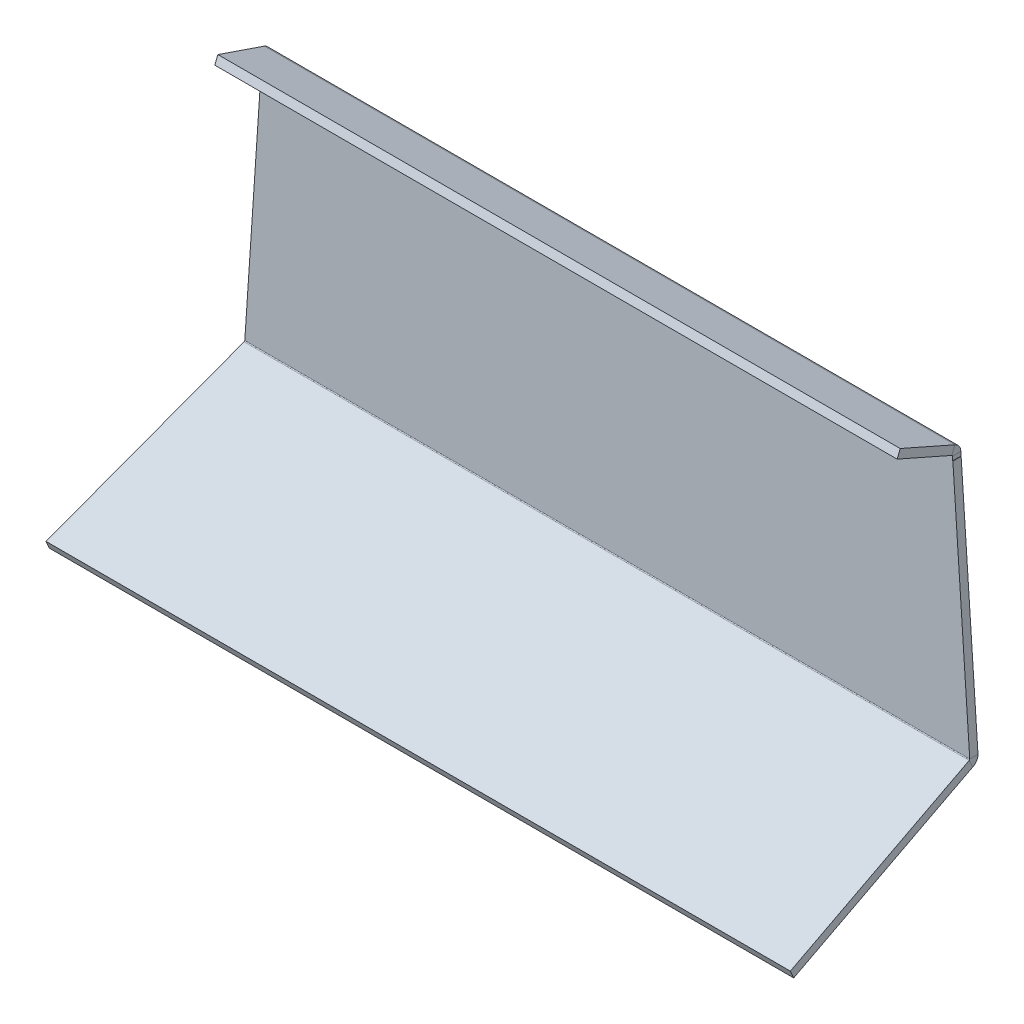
ISO-10303-21;
HEADER;
FILE_DESCRIPTION(('STEP AP214'),'2;1');
FILE_NAME('part.step','',(''),(''),'','','');
FILE_SCHEMA(('AUTOMOTIVE_DESIGN { 1 0 10303 214 1 1 1 1 }'));
ENDSEC;
DATA;
#1=APPLICATION_CONTEXT('core data for automotive mechanical design processes');
#2=APPLICATION_PROTOCOL_DEFINITION('international standard','automotive_design',2000,#1);
#3=PRODUCT_CONTEXT('',#1,'mechanical');
#4=PRODUCT('Part','Part','',(#3));
#5=PRODUCT_RELATED_PRODUCT_CATEGORY('part','',(#4));
#6=PRODUCT_DEFINITION_FORMATION('','',#4);
#7=PRODUCT_DEFINITION_CONTEXT('part definition',#1,'design');
#8=PRODUCT_DEFINITION('design','',#6,#7);
#9=PRODUCT_DEFINITION_SHAPE('','',#8);
#10=(LENGTH_UNIT() NAMED_UNIT(*) SI_UNIT(.MILLI.,.METRE.));
#11=(NAMED_UNIT(*) PLANE_ANGLE_UNIT() SI_UNIT($,.RADIAN.));
#12=(NAMED_UNIT(*) SI_UNIT($,.STERADIAN.) SOLID_ANGLE_UNIT());
#13=UNCERTAINTY_MEASURE_WITH_UNIT(LENGTH_MEASURE(1.E-05),#10,'distance_accuracy_value','');
#14=(GEOMETRIC_REPRESENTATION_CONTEXT(3) GLOBAL_UNCERTAINTY_ASSIGNED_CONTEXT((#13)) GLOBAL_UNIT_ASSIGNED_CONTEXT((#10,
#11,#12)) REPRESENTATION_CONTEXT('',''));
#15=CARTESIAN_POINT('',(0.,0.,0.));
#16=DIRECTION('',(0.,0.,1.));
#17=DIRECTION('',(1.,0.,0.));
#18=AXIS2_PLACEMENT_3D('',#15,#16,#17);
#19=CARTESIAN_POINT('',(-263.,-185.,6.));
#20=DIRECTION('',(0.997725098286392,-0.0674138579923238,0.));
#21=DIRECTION('',(0.0674138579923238,0.997725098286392,0.));
#22=AXIS2_PLACEMENT_3D('',#19,#20,#21);
#23=PLANE('',#22);
#24=DIRECTION('',(0.,0.,1.));
#25=VECTOR('',#24,1.);
#26=CARTESIAN_POINT('',(-250.736526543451,-3.50059284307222,6.00000000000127));
#27=LINE('',#26,#25);
#28=CARTESIAN_POINT('',(-250.736526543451,-3.50059284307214,0.));
#29=VERTEX_POINT('',#28);
#30=CARTESIAN_POINT('',(-250.736526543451,-3.50059284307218,6.));
#31=VERTEX_POINT('',#30);
#32=EDGE_CURVE('E262',#29,#31,#27,.T.);
#33=ORIENTED_EDGE('',*,*,#32,.F.);
#34=DIRECTION('',(-0.0674138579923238,-0.997725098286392,0.));
#35=VECTOR('',#34,1.);
#36=CARTESIAN_POINT('',(-263.,-185.,0.));
#37=LINE('',#36,#35);
#38=CARTESIAN_POINT('',(-262.967598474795,-184.520457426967,0.));
#39=VERTEX_POINT('',#38);
#40=EDGE_CURVE('E63',#29,#39,#37,.T.);
#41=ORIENTED_EDGE('',*,*,#40,.T.);
#42=DIRECTION('',(0.,0.,-1.));
#43=VECTOR('',#42,1.);
#44=CARTESIAN_POINT('',(-262.967598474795,-184.520457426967,5.99999999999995));
#45=LINE('',#44,#43);
#46=CARTESIAN_POINT('',(-262.967598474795,-184.520457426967,5.99999999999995));
#47=VERTEX_POINT('',#46);
#48=EDGE_CURVE('E338',#47,#39,#45,.T.);
#49=ORIENTED_EDGE('',*,*,#48,.F.);
#50=DIRECTION('',(-0.0674138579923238,-0.997725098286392,0.));
#51=VECTOR('',#50,1.);
#52=CARTESIAN_POINT('',(-263.,-185.,6.));
#53=LINE('',#52,#51);
#54=EDGE_CURVE('E353',#31,#47,#53,.T.);
#55=ORIENTED_EDGE('',*,*,#54,.F.);
#56=EDGE_LOOP('',(#33,#41,#49,#55));
#57=FACE_BOUND('',#56,.T.);
#58=ADVANCED_FACE('F41',(#57),#23,.F.);
#59=CARTESIAN_POINT('',(250.5,0.,6.));
#60=DIRECTION('',(-0.997725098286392,-0.0674138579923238,0.));
#61=DIRECTION('',(0.0674138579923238,-0.997725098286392,0.));
#62=AXIS2_PLACEMENT_3D('',#59,#60,#61);
#63=PLANE('',#62);
#64=DIRECTION('',(0.,0.,-1.));
#65=VECTOR('',#64,1.);
#66=CARTESIAN_POINT('',(250.736526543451,-3.50059284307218,5.99999999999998));
#67=LINE('',#66,#65);
#68=CARTESIAN_POINT('',(250.736526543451,-3.50059284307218,6.));
#69=VERTEX_POINT('',#68);
#70=CARTESIAN_POINT('',(250.736526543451,-3.50059284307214,0.));
#71=VERTEX_POINT('',#70);
#72=EDGE_CURVE('E55',#69,#71,#67,.T.);
#73=ORIENTED_EDGE('',*,*,#72,.F.);
#74=DIRECTION('',(-0.0674138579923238,0.997725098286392,0.));
#75=VECTOR('',#74,1.);
#76=CARTESIAN_POINT('',(250.5,0.,6.));
#77=LINE('',#76,#75);
#78=CARTESIAN_POINT('',(262.967598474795,-184.520457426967,5.99999999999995));
#79=VERTEX_POINT('',#78);
#80=EDGE_CURVE('E355',#79,#69,#77,.T.);
#81=ORIENTED_EDGE('',*,*,#80,.F.);
#82=DIRECTION('',(0.,0.,-1.));
#83=VECTOR('',#82,1.);
#84=CARTESIAN_POINT('',(262.967598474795,-184.520457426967,5.99999999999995));
#85=LINE('',#84,#83);
#86=CARTESIAN_POINT('',(262.967598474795,-184.520457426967,0.));
#87=VERTEX_POINT('',#86);
#88=EDGE_CURVE('E346',#79,#87,#85,.T.);
#89=ORIENTED_EDGE('',*,*,#88,.T.);
#90=DIRECTION('',(-0.0674138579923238,0.997725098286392,0.));
#91=VECTOR('',#90,1.);
#92=CARTESIAN_POINT('',(250.5,0.,0.));
#93=LINE('',#92,#91);
#94=EDGE_CURVE('E350',#87,#71,#93,.T.);
#95=ORIENTED_EDGE('',*,*,#94,.T.);
#96=EDGE_LOOP('',(#73,#81,#89,#95));
#97=FACE_BOUND('',#96,.T.);
#98=ADVANCED_FACE('F390',(#97),#63,.F.);
#99=CARTESIAN_POINT('',(-250.5,0.,6.));
#100=DIRECTION('',(0.,0.,-1.));
#101=DIRECTION('',(-1.,0.,0.));
#102=AXIS2_PLACEMENT_3D('',#99,#100,#101);
#103=PLANE('',#102);
#104=DIRECTION('',(1.,0.,0.));
#105=VECTOR('',#104,1.);
#106=CARTESIAN_POINT('',(-253.5,-3.50059284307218,6.));
#107=LINE('',#106,#105);
#108=CARTESIAN_POINT('',(-250.5,-3.50059284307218,6.));
#109=VERTEX_POINT('',#108);
#110=EDGE_CURVE('E246',#31,#109,#107,.T.);
#111=ORIENTED_EDGE('',*,*,#110,.F.);
#112=ORIENTED_EDGE('',*,*,#54,.T.);
#113=DIRECTION('',(1.,0.,0.));
#114=VECTOR('',#113,1.);
#115=CARTESIAN_POINT('',(263.022378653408,-184.520457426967,5.99999999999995));
#116=LINE('',#115,#114);
#117=EDGE_CURVE('E295',#79,#47,#116,.F.);
#118=ORIENTED_EDGE('',*,*,#117,.F.);
#119=ORIENTED_EDGE('',*,*,#80,.T.);
#120=DIRECTION('',(1.,0.,0.));
#121=VECTOR('',#120,1.);
#122=CARTESIAN_POINT('',(250.5,-3.50059284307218,6.));
#123=LINE('',#122,#121);
#124=CARTESIAN_POINT('',(250.5,-3.50059284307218,6.));
#125=VERTEX_POINT('',#124);
#126=EDGE_CURVE('E255',#125,#69,#123,.T.);
#127=ORIENTED_EDGE('',*,*,#126,.F.);
#128=DIRECTION('',(0.,-1.,0.));
#129=VECTOR('',#128,1.);
#130=CARTESIAN_POINT('',(250.5,-0.500592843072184,6.));
#131=LINE('',#130,#129);
#132=CARTESIAN_POINT('',(250.5,-0.500592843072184,6.));
#133=VERTEX_POINT('',#132);
#134=EDGE_CURVE('E252',#133,#125,#131,.T.);
#135=ORIENTED_EDGE('',*,*,#134,.F.);
#136=DIRECTION('',(-1.,0.,0.));
#137=VECTOR('',#136,1.);
#138=CARTESIAN_POINT('',(-250.5,-0.500592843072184,6.));
#139=LINE('',#138,#137);
#140=CARTESIAN_POINT('',(-250.5,-0.500592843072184,6.));
#141=VERTEX_POINT('',#140);
#142=EDGE_CURVE('E201',#141,#133,#139,.F.);
#143=ORIENTED_EDGE('',*,*,#142,.F.);
#144=DIRECTION('',(0.,1.,0.));
#145=VECTOR('',#144,1.);
#146=CARTESIAN_POINT('',(-250.5,-3.50059284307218,6.));
#147=LINE('',#146,#145);
#148=EDGE_CURVE('E248',#109,#141,#147,.T.);
#149=ORIENTED_EDGE('',*,*,#148,.F.);
#150=EDGE_LOOP('',(#111,#112,#118,#119,#127,#135,#143,#149));
#151=FACE_BOUND('',#150,.T.);
#152=ADVANCED_FACE('F374',(#151),#103,.F.);
#153=CARTESIAN_POINT('',(-250.5,0.,0.));
#154=DIRECTION('',(0.,0.,-1.));
#155=DIRECTION('',(-1.,0.,0.));
#156=AXIS2_PLACEMENT_3D('',#153,#154,#155);
#157=PLANE('',#156);
#158=ORIENTED_EDGE('',*,*,#40,.F.);
#159=DIRECTION('',(1.,0.,0.));
#160=VECTOR('',#159,1.);
#161=CARTESIAN_POINT('',(-250.5,-3.50059284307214,0.));
#162=LINE('',#161,#160);
#163=CARTESIAN_POINT('',(-250.5,-3.50059284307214,0.));
#164=VERTEX_POINT('',#163);
#165=EDGE_CURVE('E11',#29,#164,#162,.T.);
#166=ORIENTED_EDGE('',*,*,#165,.T.);
#167=DIRECTION('',(0.,1.,0.));
#168=VECTOR('',#167,1.);
#169=CARTESIAN_POINT('',(-250.5,0.,0.));
#170=LINE('',#169,#168);
#171=CARTESIAN_POINT('',(-250.5,-0.500592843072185,0.));
#172=VERTEX_POINT('',#171);
#173=EDGE_CURVE('E48',#164,#172,#170,.T.);
#174=ORIENTED_EDGE('',*,*,#173,.T.);
#175=DIRECTION('',(-1.,0.,0.));
#176=VECTOR('',#175,1.);
#177=CARTESIAN_POINT('',(-250.5,-0.500592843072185,0.));
#178=LINE('',#177,#176);
#179=CARTESIAN_POINT('',(250.5,-0.500592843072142,0.));
#180=VERTEX_POINT('',#179);
#181=EDGE_CURVE('E161',#172,#180,#178,.F.);
#182=ORIENTED_EDGE('',*,*,#181,.T.);
#183=DIRECTION('',(0.,-1.,0.));
#184=VECTOR('',#183,1.);
#185=CARTESIAN_POINT('',(250.5,0.,0.));
#186=LINE('',#185,#184);
#187=CARTESIAN_POINT('',(250.5,-3.50059284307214,0.));
#188=VERTEX_POINT('',#187);
#189=EDGE_CURVE('E360',#180,#188,#186,.T.);
#190=ORIENTED_EDGE('',*,*,#189,.T.);
#191=DIRECTION('',(1.,0.,0.));
#192=VECTOR('',#191,1.);
#193=CARTESIAN_POINT('',(-250.5,-3.50059284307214,0.));
#194=LINE('',#193,#192);
#195=EDGE_CURVE('E358',#188,#71,#194,.T.);
#196=ORIENTED_EDGE('',*,*,#195,.T.);
#197=ORIENTED_EDGE('',*,*,#94,.F.);
#198=DIRECTION('',(1.,0.,0.));
#199=VECTOR('',#198,1.);
#200=CARTESIAN_POINT('',(263.022378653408,-184.520457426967,0.));
#201=LINE('',#200,#199);
#202=EDGE_CURVE('E304',#87,#39,#201,.F.);
#203=ORIENTED_EDGE('',*,*,#202,.T.);
#204=EDGE_LOOP('',(#158,#166,#174,#182,#190,#196,#197,#203));
#205=FACE_BOUND('',#204,.T.);
#206=ADVANCED_FACE('F364',(#205),#157,.T.);
#207=CARTESIAN_POINT('',(-262.967598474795,-184.520457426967,-0.060000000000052));
#208=CARTESIAN_POINT('',(-262.97673610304,-185.82896918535,-0.0600000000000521));
#209=CARTESIAN_POINT('',(-262.985858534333,-187.132926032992,0.327377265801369));
#210=CARTESIAN_POINT('',(-263.00411859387,-189.324304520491,1.75401218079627));
#211=CARTESIAN_POINT('',(-263.013241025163,-190.20621071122,2.78967915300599));
#212=CARTESIAN_POINT('',(-263.022378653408,-190.735716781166,3.98626861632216));
#213=CARTESIAN_POINT('',(-262.967598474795,-184.520457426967,0.));
#214=CARTESIAN_POINT('',(-262.97673610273,-185.817417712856,0.));
#215=CARTESIAN_POINT('',(-262.985858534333,-187.109863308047,0.383957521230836));
#216=CARTESIAN_POINT('',(-263.00411859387,-189.281896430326,1.7979981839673));
#217=CARTESIAN_POINT('',(-263.013241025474,-190.156017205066,2.82452235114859));
#218=CARTESIAN_POINT('',(-263.022378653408,-190.680848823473,4.01054838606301));
#219=CARTESIAN_POINT('',(-262.967598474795,-184.520457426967,5.99999999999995));
#220=CARTESIAN_POINT('',(-262.97673607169,-184.662270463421,5.99999999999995));
#221=CARTESIAN_POINT('',(-262.985858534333,-184.803590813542,6.04198306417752));
#222=CARTESIAN_POINT('',(-263.00411859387,-185.041087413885,6.19659850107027));
#223=CARTESIAN_POINT('',(-263.013241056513,-185.136666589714,6.30884216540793));
#224=CARTESIAN_POINT('',(-263.022378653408,-185.194053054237,6.43852536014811));
#225=B_SPLINE_SURFACE_WITH_KNOTS('',1,3,((#207,#208,#209,#210,#211,#212),(#213,#214,#215,#216,
#217,#218),(#219,#220,#221,#222,#223,#224)),.UNSPECIFIED.,.F.,.F.,.F.,(2,1,2),(4,2,4),(-0.01,0.,
1.),(0.,0.5,1.),.UNSPECIFIED.);
#226=DIRECTION('',(0.,-0.914465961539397,-0.404662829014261));
#227=VECTOR('',#226,1.);
#228=CARTESIAN_POINT('',(-263.022378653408,-185.194053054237,6.4385253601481));
#229=LINE('',#228,#227);
#230=CARTESIAN_POINT('',(-263.022378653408,-185.194053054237,6.43852536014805));
#231=VERTEX_POINT('',#230);
#232=CARTESIAN_POINT('',(-263.022378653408,-190.680848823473,4.01054838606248));
#233=VERTEX_POINT('',#232);
#234=EDGE_CURVE('E264',#231,#233,#229,.T.);
#235=CARTESIAN_POINT('',(-262.967598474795,-184.520457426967,5.99999999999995));
#236=CARTESIAN_POINT('',(-262.968169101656,-184.529313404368,5.99999992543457));
#237=CARTESIAN_POINT('',(-262.968739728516,-184.538169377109,6.00015970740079));
#238=CARTESIAN_POINT('',(-262.969880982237,-184.55586980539,6.00079844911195));
#239=CARTESIAN_POINT('',(-262.970451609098,-184.56471426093,6.00127740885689));
#240=CARTESIAN_POINT('',(-262.971592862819,-184.582380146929,6.002553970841));
#241=CARTESIAN_POINT('',(-262.97216348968,-184.591201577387,6.00335157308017));
#242=CARTESIAN_POINT('',(-262.973304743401,-184.608809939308,6.00526435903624));
#243=CARTESIAN_POINT('',(-262.973875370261,-184.617596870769,6.00637954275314));
#244=CARTESIAN_POINT('',(-262.975016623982,-184.63512480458,6.00892604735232));
#245=CARTESIAN_POINT('',(-262.975587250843,-184.64386580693,6.01035736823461));
#246=CARTESIAN_POINT('',(-262.976728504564,-184.661290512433,6.01353428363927));
#247=CARTESIAN_POINT('',(-262.977299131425,-184.669974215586,6.01527987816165));
#248=CARTESIAN_POINT('',(-262.978440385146,-184.687273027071,6.01908307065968));
#249=CARTESIAN_POINT('',(-262.979011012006,-184.695888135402,6.02114066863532));
#250=CARTESIAN_POINT('',(-262.980152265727,-184.713038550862,6.02556519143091));
#251=CARTESIAN_POINT('',(-262.980722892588,-184.721573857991,6.02793211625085));
#252=CARTESIAN_POINT('',(-262.981864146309,-184.738553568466,6.03297221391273));
#253=CARTESIAN_POINT('',(-262.98243477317,-184.746997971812,6.03564538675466));
#254=CARTESIAN_POINT('',(-262.983576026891,-184.763784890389,6.04129450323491));
#255=CARTESIAN_POINT('',(-262.984146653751,-184.77212740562,6.04427044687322));
#256=CARTESIAN_POINT('',(-262.985287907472,-184.788699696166,6.05052123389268));
#257=CARTESIAN_POINT('',(-262.985858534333,-184.796929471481,6.05379607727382));
#258=CARTESIAN_POINT('',(-262.986999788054,-184.813265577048,6.06064040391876));
#259=CARTESIAN_POINT('',(-262.987570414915,-184.821371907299,6.06420988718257));
#260=CARTESIAN_POINT('',(-262.988711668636,-184.837450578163,6.07163885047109));
#261=CARTESIAN_POINT('',(-262.989282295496,-184.845422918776,6.07549833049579));
#262=CARTESIAN_POINT('',(-262.990423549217,-184.861223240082,6.08350226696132));
#263=CARTESIAN_POINT('',(-262.990994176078,-184.869051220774,6.08764672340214));
#264=CARTESIAN_POINT('',(-262.992135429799,-184.884552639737,6.09621522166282));
#265=CARTESIAN_POINT('',(-262.992706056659,-184.892226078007,6.10063926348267));
#266=CARTESIAN_POINT('',(-262.993847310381,-184.90740843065,6.10976117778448));
#267=CARTESIAN_POINT('',(-262.994417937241,-184.914917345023,6.11445905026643));
#268=CARTESIAN_POINT('',(-262.995559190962,-184.929760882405,6.12412251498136));
#269=CARTESIAN_POINT('',(-262.996129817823,-184.937095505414,6.12908810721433));
#270=CARTESIAN_POINT('',(-262.997271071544,-184.951580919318,6.13928055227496));
#271=CARTESIAN_POINT('',(-262.997841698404,-184.958731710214,6.14450740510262));
#272=CARTESIAN_POINT('',(-262.998982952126,-184.972840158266,6.15521557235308));
#273=CARTESIAN_POINT('',(-262.999553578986,-184.979797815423,6.16069688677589));
#274=CARTESIAN_POINT('',(-263.000694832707,-184.993510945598,6.17190684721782));
#275=CARTESIAN_POINT('',(-263.001265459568,-185.000266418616,6.17763549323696));
#276=CARTESIAN_POINT('',(-263.002406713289,-185.013566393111,6.18933266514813));
#277=CARTESIAN_POINT('',(-263.002977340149,-185.020110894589,6.19530119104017));
#278=CARTESIAN_POINT('',(-263.004118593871,-185.032980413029,6.20747035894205));
#279=CARTESIAN_POINT('',(-263.004689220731,-185.039305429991,6.21367100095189));
#280=CARTESIAN_POINT('',(-263.005830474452,-185.051727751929,6.22629633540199));
#281=CARTESIAN_POINT('',(-263.006401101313,-185.057825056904,6.23272102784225));
#282=CARTESIAN_POINT('',(-263.007542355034,-185.0697840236,6.2457861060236));
#283=CARTESIAN_POINT('',(-263.008112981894,-185.075645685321,6.25242649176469));
#284=CARTESIAN_POINT('',(-263.009254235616,-185.087125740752,6.26591431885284));
#285=CARTESIAN_POINT('',(-263.009824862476,-185.092744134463,6.27276176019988));
#286=CARTESIAN_POINT('',(-263.010966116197,-185.103730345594,6.28665479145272));
#287=CARTESIAN_POINT('',(-263.011536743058,-185.109098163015,6.2937003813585));
#288=CARTESIAN_POINT('',(-263.012677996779,-185.119576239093,6.3079805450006));
#289=CARTESIAN_POINT('',(-263.013248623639,-185.124686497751,6.31521511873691));
#290=CARTESIAN_POINT('',(-263.01438987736,-185.134642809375,6.32986383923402));
#291=CARTESIAN_POINT('',(-263.014960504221,-185.139488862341,6.33727798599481));
#292=CARTESIAN_POINT('',(-263.016101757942,-185.148910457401,6.35227620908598));
#293=CARTESIAN_POINT('',(-263.016672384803,-185.153485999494,6.35986028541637));
#294=CARTESIAN_POINT('',(-263.017813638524,-185.162360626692,6.37518849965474));
#295=CARTESIAN_POINT('',(-263.018384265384,-185.166659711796,6.38293263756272));
#296=CARTESIAN_POINT('',(-263.019525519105,-185.174975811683,6.39857091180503));
#297=CARTESIAN_POINT('',(-263.020096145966,-185.178992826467,6.40646504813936));
#298=CARTESIAN_POINT('',(-263.021237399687,-185.186739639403,6.42239301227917));
#299=CARTESIAN_POINT('',(-263.021808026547,-185.190469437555,6.43042684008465));
#300=CARTESIAN_POINT('',(-263.022378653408,-185.194053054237,6.43852536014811));
#301=B_SPLINE_CURVE_WITH_KNOTS('',3,(#235,#236,#237,#238,#239,#240,#241,#242,#243,#244,#245,
#246,#247,#248,#249,#250,#251,#252,#253,#254,#255,#256,#257,#258,#259,#260,#261,#262,#263,#264,
#265,#266,#267,#268,#269,#270,#271,#272,#273,#274,#275,#276,#277,#278,#279,#280,#281,#282,#283,
#284,#285,#286,#287,#288,#289,#290,#291,#292,#293,#294,#295,#296,#297,#298,#299,#300),
.UNSPECIFIED.,.F.,.F.,(4,2,2,2,2,2,2,2,2,2,2,2,2,2,2,2,2,2,2,2,2,2,2,2,2,2,2,2,2,2,2,2,4),(0.,
0.0266215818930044,0.0532431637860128,0.079864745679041,0.106486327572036,0.133107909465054,
0.159729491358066,0.186351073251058,0.212972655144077,0.239594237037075,0.266215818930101,
0.292837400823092,0.319458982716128,0.346080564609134,0.372702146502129,0.399323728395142,
0.425945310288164,0.452566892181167,0.479188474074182,0.505810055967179,0.532431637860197,
0.559053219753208,0.585674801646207,0.612296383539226,0.63891796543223,0.665539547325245,
0.692161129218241,0.718782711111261,0.745404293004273,0.772025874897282,0.79864745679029,
0.825269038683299,0.851890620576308),.UNSPECIFIED.);
#302=EDGE_CURVE('E298',#47,#231,#301,.T.);
#303=CARTESIAN_POINT('',(-262.967598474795,-184.520457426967,0.));
#304=CARTESIAN_POINT('',(-262.968169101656,-184.601450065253,-6.81940224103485E-07));
#305=CARTESIAN_POINT('',(-262.968739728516,-184.682442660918,0.00146060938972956));
#306=CARTESIAN_POINT('',(-262.969880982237,-184.8443225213,0.00730224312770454));
#307=CARTESIAN_POINT('',(-262.970451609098,-184.925209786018,0.0116825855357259));
#308=CARTESIAN_POINT('',(-262.971592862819,-185.086773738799,0.0233574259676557));
#309=CARTESIAN_POINT('',(-262.97216348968,-185.167450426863,0.0306519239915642));
#310=CARTESIAN_POINT('',(-262.973304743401,-185.328488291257,0.0481453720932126));
#311=CARTESIAN_POINT('',(-262.973875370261,-185.408849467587,0.0583443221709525));
#312=CARTESIAN_POINT('',(-262.975016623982,-185.569151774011,0.0816334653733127));
#313=CARTESIAN_POINT('',(-262.975587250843,-185.649092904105,0.094723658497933));
#314=CARTESIAN_POINT('',(-262.976728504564,-185.808451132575,0.12377824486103));
#315=CARTESIAN_POINT('',(-262.977299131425,-185.887868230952,0.139742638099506));
#316=CARTESIAN_POINT('',(-262.978440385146,-186.046075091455,0.174524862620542));
#317=CARTESIAN_POINT('',(-262.979011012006,-186.12486485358,0.193342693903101));
#318=CARTESIAN_POINT('',(-262.980152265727,-186.281714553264,0.233807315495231));
#319=CARTESIAN_POINT('',(-262.980722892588,-186.359774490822,0.255454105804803));
#320=CARTESIAN_POINT('',(-262.981864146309,-186.515063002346,0.301548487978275));
#321=CARTESIAN_POINT('',(-262.98243477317,-186.592291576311,0.325996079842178));
#322=CARTESIAN_POINT('',(-262.983576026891,-186.745816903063,0.377660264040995));
#323=CARTESIAN_POINT('',(-262.984146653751,-186.822113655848,0.40487685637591));
#324=CARTESIAN_POINT('',(-262.985287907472,-186.973676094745,0.462043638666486));
#325=CARTESIAN_POINT('',(-262.985858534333,-187.048941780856,0.491993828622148));
#326=CARTESIAN_POINT('',(-262.986999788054,-187.198344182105,0.554588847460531));
#327=CARTESIAN_POINT('',(-262.987570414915,-187.272480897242,0.587233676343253));
#328=CARTESIAN_POINT('',(-262.988711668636,-187.419528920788,0.655175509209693));
#329=CARTESIAN_POINT('',(-262.989282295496,-187.492440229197,0.690472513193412));
#330=CARTESIAN_POINT('',(-262.990423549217,-187.636942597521,0.763672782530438));
#331=CARTESIAN_POINT('',(-262.990994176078,-187.708533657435,0.801576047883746));
#332=CARTESIAN_POINT('',(-262.992135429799,-187.85030240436,0.87993953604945));
#333=CARTESIAN_POINT('',(-262.992706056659,-187.92048009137,0.920399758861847));
#334=CARTESIAN_POINT('',(-262.993847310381,-188.059330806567,1.00382453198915));
#335=CARTESIAN_POINT('',(-262.994417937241,-188.128003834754,1.04678908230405));
#336=CARTESIAN_POINT('',(-262.995559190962,-188.26375590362,1.135166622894));
#337=CARTESIAN_POINT('',(-262.996129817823,-188.330834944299,1.18057961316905));
#338=CARTESIAN_POINT('',(-262.997271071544,-188.463311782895,1.27379496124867));
#339=CARTESIAN_POINT('',(-262.997841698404,-188.528709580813,1.32159731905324));
#340=CARTESIAN_POINT('',(-262.998982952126,-188.657738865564,1.41952922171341));
#341=CARTESIAN_POINT('',(-262.999553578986,-188.721370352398,1.46965876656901));
#342=CARTESIAN_POINT('',(-263.000694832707,-188.846784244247,1.57217983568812));
#343=CARTESIAN_POINT('',(-263.001265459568,-188.908566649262,1.62457135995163));
#344=CARTESIAN_POINT('',(-263.002406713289,-189.030202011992,1.73154823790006));
#345=CARTESIAN_POINT('',(-263.002977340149,-189.090054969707,1.78613359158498));
#346=CARTESIAN_POINT('',(-263.004118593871,-189.207753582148,1.89742712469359));
#347=CARTESIAN_POINT('',(-263.004689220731,-189.265599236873,1.95413530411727));
#348=CARTESIAN_POINT('',(-263.005830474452,-189.379207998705,2.06960072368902));
#349=CARTESIAN_POINT('',(-263.006401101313,-189.434971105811,2.12835796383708));
#350=CARTESIAN_POINT('',(-263.007542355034,-189.54434223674,2.24784507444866));
#351=CARTESIAN_POINT('',(-263.008112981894,-189.597950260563,2.30857494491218));
#352=CARTESIAN_POINT('',(-263.009254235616,-189.702941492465,2.43192831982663));
#353=CARTESIAN_POINT('',(-263.009824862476,-189.754324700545,2.49455182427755));
#354=CARTESIAN_POINT('',(-263.010966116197,-189.854799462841,2.62161100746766));
#355=CARTESIAN_POINT('',(-263.011536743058,-189.903891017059,2.68604668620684));
#356=CARTESIAN_POINT('',(-263.012677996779,-189.99971861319,2.81664640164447));
#357=CARTESIAN_POINT('',(-263.013248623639,-190.046454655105,2.8828104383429));
#358=CARTESIAN_POINT('',(-263.01438987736,-190.13751043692,3.01678080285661));
#359=CARTESIAN_POINT('',(-263.014960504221,-190.18183017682,3.08458713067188));
#360=CARTESIAN_POINT('',(-263.016101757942,-190.267995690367,3.22175388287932));
#361=CARTESIAN_POINT('',(-263.016672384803,-190.309841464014,3.29111430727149));
#362=CARTESIAN_POINT('',(-263.017813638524,-190.391004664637,3.43129900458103));
#363=CARTESIAN_POINT('',(-263.018384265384,-190.430322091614,3.50212327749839));
#364=CARTESIAN_POINT('',(-263.019525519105,-190.506377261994,3.64514363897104));
#365=CARTESIAN_POINT('',(-263.020096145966,-190.543115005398,3.71733972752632));
#366=CARTESIAN_POINT('',(-263.021237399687,-190.613963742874,3.86300945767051));
#367=CARTESIAN_POINT('',(-263.021808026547,-190.648074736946,3.93648309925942));
#368=CARTESIAN_POINT('',(-263.022378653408,-190.680848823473,4.01054838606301));
#369=B_SPLINE_CURVE_WITH_KNOTS('',3,(#303,#304,#305,#306,#307,#308,#309,#310,#311,#312,#313,
#314,#315,#316,#317,#318,#319,#320,#321,#322,#323,#324,#325,#326,#327,#328,#329,#330,#331,#332,
#333,#334,#335,#336,#337,#338,#339,#340,#341,#342,#343,#344,#345,#346,#347,#348,#349,#350,#351,
#352,#353,#354,#355,#356,#357,#358,#359,#360,#361,#362,#363,#364,#365,#366,#367,#368),
.UNSPECIFIED.,.F.,.F.,(4,2,2,2,2,2,2,2,2,2,2,2,2,2,2,2,2,2,2,2,2,2,2,2,2,2,2,2,2,2,2,2,4),(0.,
0.242970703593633,0.485941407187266,0.728912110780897,0.971882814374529,1.21485351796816,
1.4578242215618,1.70079492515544,1.94376562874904,2.18673633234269,2.42970703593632,
2.67267773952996,2.9156484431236,3.15861914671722,3.40158985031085,3.64456055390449,
3.88753125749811,4.13050196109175,4.37347266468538,4.616443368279,4.85941407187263,
5.10238477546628,5.34535547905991,5.58832618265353,5.83129688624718,6.07426758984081,
6.31723829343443,6.56020899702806,6.8031797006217,7.04615040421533,7.28912110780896,
7.5320918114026,7.77506251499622),.UNSPECIFIED.);
#370=EDGE_CURVE('E328',#39,#233,#369,.T.);
#371=ORIENTED_EDGE('',*,*,#234,.F.);
#372=ORIENTED_EDGE('',*,*,#302,.F.);
#373=ORIENTED_EDGE('',*,*,#48,.T.);
#374=ORIENTED_EDGE('',*,*,#370,.T.);
#375=EDGE_LOOP('',(#371,#372,#373,#374));
#376=FACE_BOUND('',#375,.T.);
#377=ADVANCED_FACE('F381',(#376),#225,.F.);
#378=CARTESIAN_POINT('',(263.022378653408,-190.735716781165,3.98626861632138));
#379=CARTESIAN_POINT('',(263.013241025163,-190.206210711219,2.78967915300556));
#380=CARTESIAN_POINT('',(263.004118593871,-189.32430452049,1.75401218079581));
#381=CARTESIAN_POINT('',(262.985858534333,-187.132926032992,0.327377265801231));
#382=CARTESIAN_POINT('',(262.97673610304,-185.82896918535,-0.0600000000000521));
#383=CARTESIAN_POINT('',(262.967598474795,-184.520457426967,-0.060000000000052));
#384=CARTESIAN_POINT('',(263.022378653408,-190.680848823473,4.01054838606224));
#385=CARTESIAN_POINT('',(263.013241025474,-190.156017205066,2.82452235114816));
#386=CARTESIAN_POINT('',(263.004118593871,-189.281896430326,1.79799818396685));
#387=CARTESIAN_POINT('',(262.985858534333,-187.109863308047,0.383957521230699));
#388=CARTESIAN_POINT('',(262.97673610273,-185.817417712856,0.));
#389=CARTESIAN_POINT('',(262.967598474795,-184.520457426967,0.));
#390=CARTESIAN_POINT('',(263.022378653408,-185.194053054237,6.43852536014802));
#391=CARTESIAN_POINT('',(263.013241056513,-185.136666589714,6.30884216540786));
#392=CARTESIAN_POINT('',(263.004118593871,-185.041087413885,6.19659850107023));
#393=CARTESIAN_POINT('',(262.985858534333,-184.803590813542,6.04198306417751));
#394=CARTESIAN_POINT('',(262.97673607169,-184.662270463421,5.99999999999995));
#395=CARTESIAN_POINT('',(262.967598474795,-184.520457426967,5.99999999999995));
#396=B_SPLINE_SURFACE_WITH_KNOTS('',1,3,((#378,#379,#380,#381,#382,#383),(#384,#385,#386,#387,
#388,#389),(#390,#391,#392,#393,#394,#395)),.UNSPECIFIED.,.F.,.F.,.F.,(2,1,2),(4,2,4),(-0.01,0.,
1.),(0.,0.5,1.),.UNSPECIFIED.);
#397=CARTESIAN_POINT('',(263.022378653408,-185.194053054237,6.43852536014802));
#398=CARTESIAN_POINT('',(263.021808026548,-185.190469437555,6.43042684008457));
#399=CARTESIAN_POINT('',(263.021237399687,-185.186739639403,6.42239301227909));
#400=CARTESIAN_POINT('',(263.020096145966,-185.178992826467,6.40646504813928));
#401=CARTESIAN_POINT('',(263.019525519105,-185.174975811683,6.39857091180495));
#402=CARTESIAN_POINT('',(263.018384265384,-185.166659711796,6.38293263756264));
#403=CARTESIAN_POINT('',(263.017813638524,-185.162360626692,6.37518849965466));
#404=CARTESIAN_POINT('',(263.016672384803,-185.153485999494,6.3598602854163));
#405=CARTESIAN_POINT('',(263.016101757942,-185.1489104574,6.35227620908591));
#406=CARTESIAN_POINT('',(263.014960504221,-185.139488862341,6.33727798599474));
#407=CARTESIAN_POINT('',(263.01438987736,-185.134642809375,6.32986383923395));
#408=CARTESIAN_POINT('',(263.013248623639,-185.124686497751,6.31521511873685));
#409=CARTESIAN_POINT('',(263.012677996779,-185.119576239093,6.30798054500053));
#410=CARTESIAN_POINT('',(263.011536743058,-185.109098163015,6.29370038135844));
#411=CARTESIAN_POINT('',(263.010966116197,-185.103730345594,6.28665479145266));
#412=CARTESIAN_POINT('',(263.009824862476,-185.092744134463,6.27276176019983));
#413=CARTESIAN_POINT('',(263.009254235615,-185.087125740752,6.26591431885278));
#414=CARTESIAN_POINT('',(263.008112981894,-185.07564568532,6.25242649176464));
#415=CARTESIAN_POINT('',(263.007542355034,-185.0697840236,6.24578610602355));
#416=CARTESIAN_POINT('',(263.006401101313,-185.057825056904,6.2327210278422));
#417=CARTESIAN_POINT('',(263.005830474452,-185.051727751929,6.22629633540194));
#418=CARTESIAN_POINT('',(263.004689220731,-185.039305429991,6.21367100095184));
#419=CARTESIAN_POINT('',(263.00411859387,-185.032980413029,6.207470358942));
#420=CARTESIAN_POINT('',(263.002977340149,-185.020110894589,6.19530119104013));
#421=CARTESIAN_POINT('',(263.002406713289,-185.013566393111,6.18933266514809));
#422=CARTESIAN_POINT('',(263.001265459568,-185.000266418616,6.17763549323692));
#423=CARTESIAN_POINT('',(263.000694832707,-184.993510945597,6.17190684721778));
#424=CARTESIAN_POINT('',(262.999553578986,-184.979797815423,6.16069688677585));
#425=CARTESIAN_POINT('',(262.998982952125,-184.972840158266,6.15521557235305));
#426=CARTESIAN_POINT('',(262.997841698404,-184.958731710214,6.14450740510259));
#427=CARTESIAN_POINT('',(262.997271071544,-184.951580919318,6.13928055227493));
#428=CARTESIAN_POINT('',(262.996129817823,-184.937095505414,6.1290881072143));
#429=CARTESIAN_POINT('',(262.995559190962,-184.929760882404,6.12412251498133));
#430=CARTESIAN_POINT('',(262.994417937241,-184.914917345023,6.11445905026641));
#431=CARTESIAN_POINT('',(262.99384731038,-184.90740843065,6.10976117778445));
#432=CARTESIAN_POINT('',(262.992706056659,-184.892226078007,6.10063926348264));
#433=CARTESIAN_POINT('',(262.992135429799,-184.884552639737,6.09621522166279));
#434=CARTESIAN_POINT('',(262.990994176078,-184.869051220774,6.08764672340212));
#435=CARTESIAN_POINT('',(262.990423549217,-184.861223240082,6.0835022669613));
#436=CARTESIAN_POINT('',(262.989282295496,-184.845422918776,6.07549833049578));
#437=CARTESIAN_POINT('',(262.988711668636,-184.837450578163,6.07163885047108));
#438=CARTESIAN_POINT('',(262.987570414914,-184.821371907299,6.06420988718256));
#439=CARTESIAN_POINT('',(262.986999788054,-184.813265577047,6.06064040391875));
#440=CARTESIAN_POINT('',(262.985858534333,-184.796929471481,6.0537960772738));
#441=CARTESIAN_POINT('',(262.985287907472,-184.788699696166,6.05052123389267));
#442=CARTESIAN_POINT('',(262.984146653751,-184.77212740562,6.04427044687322));
#443=CARTESIAN_POINT('',(262.983576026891,-184.763784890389,6.0412945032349));
#444=CARTESIAN_POINT('',(262.982434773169,-184.746997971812,6.03564538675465));
#445=CARTESIAN_POINT('',(262.981864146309,-184.738553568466,6.03297221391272));
#446=CARTESIAN_POINT('',(262.980722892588,-184.721573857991,6.02793211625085));
#447=CARTESIAN_POINT('',(262.980152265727,-184.713038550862,6.02556519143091));
#448=CARTESIAN_POINT('',(262.979011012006,-184.695888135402,6.02114066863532));
#449=CARTESIAN_POINT('',(262.978440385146,-184.687273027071,6.01908307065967));
#450=CARTESIAN_POINT('',(262.977299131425,-184.669974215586,6.01527987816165));
#451=CARTESIAN_POINT('',(262.976728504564,-184.661290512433,6.01353428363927));
#452=CARTESIAN_POINT('',(262.975587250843,-184.64386580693,6.01035736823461));
#453=CARTESIAN_POINT('',(262.975016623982,-184.63512480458,6.00892604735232));
#454=CARTESIAN_POINT('',(262.973875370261,-184.617596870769,6.00637954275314));
#455=CARTESIAN_POINT('',(262.973304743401,-184.608809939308,6.00526435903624));
#456=CARTESIAN_POINT('',(262.972163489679,-184.591201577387,6.00335157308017));
#457=CARTESIAN_POINT('',(262.971592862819,-184.582380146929,6.002553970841));
#458=CARTESIAN_POINT('',(262.970451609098,-184.56471426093,6.00127740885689));
#459=CARTESIAN_POINT('',(262.969880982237,-184.55586980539,6.00079844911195));
#460=CARTESIAN_POINT('',(262.968739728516,-184.538169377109,6.00015970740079));
#461=CARTESIAN_POINT('',(262.968169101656,-184.529313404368,5.99999992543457));
#462=CARTESIAN_POINT('',(262.967598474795,-184.520457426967,5.99999999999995));
#463=B_SPLINE_CURVE_WITH_KNOTS('',3,(#397,#398,#399,#400,#401,#402,#403,#404,#405,#406,#407,
#408,#409,#410,#411,#412,#413,#414,#415,#416,#417,#418,#419,#420,#421,#422,#423,#424,#425,#426,
#427,#428,#429,#430,#431,#432,#433,#434,#435,#436,#437,#438,#439,#440,#441,#442,#443,#444,#445,
#446,#447,#448,#449,#450,#451,#452,#453,#454,#455,#456,#457,#458,#459,#460,#461,#462),
.UNSPECIFIED.,.F.,.F.,(4,2,2,2,2,2,2,2,2,2,2,2,2,2,2,2,2,2,2,2,2,2,2,2,2,2,2,2,2,2,2,2,4),(0.,
0.0266215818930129,0.0532431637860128,0.0798647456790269,0.106486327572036,0.133107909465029,
0.159729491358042,0.186351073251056,0.212972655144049,0.239594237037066,0.266215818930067,
0.292837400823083,0.319458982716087,0.346080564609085,0.372702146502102,0.399323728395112,
0.425945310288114,0.452566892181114,0.479188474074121,0.50581005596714,0.532431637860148,
0.559053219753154,0.585674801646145,0.612296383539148,0.638917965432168,0.66553954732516,
0.692161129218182,0.718782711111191,0.745404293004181,0.772025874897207,0.798647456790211,
0.825269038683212,0.85189062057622),.UNSPECIFIED.);
#464=CARTESIAN_POINT('',(263.022378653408,-185.194053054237,6.43852536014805));
#465=VERTEX_POINT('',#464);
#466=EDGE_CURVE('E294',#465,#79,#463,.T.);
#467=DIRECTION('',(0.,-0.914465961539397,-0.404662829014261));
#468=VECTOR('',#467,1.);
#469=CARTESIAN_POINT('',(263.022378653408,-185.194053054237,6.43852536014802));
#470=LINE('',#469,#468);
#471=CARTESIAN_POINT('',(263.022378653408,-190.680848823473,4.01054838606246));
#472=VERTEX_POINT('',#471);
#473=EDGE_CURVE('E267',#465,#472,#470,.T.);
#474=CARTESIAN_POINT('',(263.022378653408,-190.680848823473,4.01054838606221));
#475=CARTESIAN_POINT('',(263.021808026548,-190.648074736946,3.93648309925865));
#476=CARTESIAN_POINT('',(263.021237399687,-190.613963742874,3.86300945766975));
#477=CARTESIAN_POINT('',(263.020096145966,-190.543115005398,3.71733972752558));
#478=CARTESIAN_POINT('',(263.019525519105,-190.506377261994,3.6451436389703));
#479=CARTESIAN_POINT('',(263.018384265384,-190.430322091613,3.50212327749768));
#480=CARTESIAN_POINT('',(263.017813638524,-190.391004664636,3.43129900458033));
#481=CARTESIAN_POINT('',(263.016672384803,-190.309841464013,3.29111430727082));
#482=CARTESIAN_POINT('',(263.016101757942,-190.267995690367,3.22175388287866));
#483=CARTESIAN_POINT('',(263.014960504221,-190.18183017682,3.08458713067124));
#484=CARTESIAN_POINT('',(263.01438987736,-190.137510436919,3.01678080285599));
#485=CARTESIAN_POINT('',(263.013248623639,-190.046454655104,2.88281043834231));
#486=CARTESIAN_POINT('',(263.012677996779,-189.99971861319,2.81664640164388));
#487=CARTESIAN_POINT('',(263.011536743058,-189.903891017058,2.68604668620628));
#488=CARTESIAN_POINT('',(263.010966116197,-189.854799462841,2.62161100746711));
#489=CARTESIAN_POINT('',(263.009824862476,-189.754324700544,2.49455182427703));
#490=CARTESIAN_POINT('',(263.009254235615,-189.702941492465,2.43192831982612));
#491=CARTESIAN_POINT('',(263.008112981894,-189.597950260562,2.3085749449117));
#492=CARTESIAN_POINT('',(263.007542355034,-189.54434223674,2.24784507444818));
#493=CARTESIAN_POINT('',(263.006401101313,-189.434971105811,2.12835796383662));
#494=CARTESIAN_POINT('',(263.005830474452,-189.379207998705,2.06960072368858));
#495=CARTESIAN_POINT('',(263.004689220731,-189.265599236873,1.95413530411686));
#496=CARTESIAN_POINT('',(263.00411859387,-189.207753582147,1.89742712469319));
#497=CARTESIAN_POINT('',(263.002977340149,-189.090054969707,1.7861335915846));
#498=CARTESIAN_POINT('',(263.002406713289,-189.030202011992,1.73154823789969));
#499=CARTESIAN_POINT('',(263.001265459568,-188.908566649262,1.62457135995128));
#500=CARTESIAN_POINT('',(263.000694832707,-188.846784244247,1.57217983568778));
#501=CARTESIAN_POINT('',(262.999553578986,-188.721370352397,1.46965876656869));
#502=CARTESIAN_POINT('',(262.998982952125,-188.657738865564,1.4195292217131));
#503=CARTESIAN_POINT('',(262.997841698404,-188.528709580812,1.32159731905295));
#504=CARTESIAN_POINT('',(262.997271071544,-188.463311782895,1.2737949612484));
#505=CARTESIAN_POINT('',(262.996129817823,-188.330834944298,1.1805796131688));
#506=CARTESIAN_POINT('',(262.995559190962,-188.263755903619,1.13516662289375));
#507=CARTESIAN_POINT('',(262.994417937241,-188.128003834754,1.04678908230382));
#508=CARTESIAN_POINT('',(262.99384731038,-188.059330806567,1.00382453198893));
#509=CARTESIAN_POINT('',(262.992706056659,-187.92048009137,0.920399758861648));
#510=CARTESIAN_POINT('',(262.992135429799,-187.850302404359,0.879939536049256));
#511=CARTESIAN_POINT('',(262.990994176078,-187.708533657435,0.801576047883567));
#512=CARTESIAN_POINT('',(262.990423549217,-187.63694259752,0.763672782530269));
#513=CARTESIAN_POINT('',(262.989282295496,-187.492440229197,0.690472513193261));
#514=CARTESIAN_POINT('',(262.988711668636,-187.419528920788,0.655175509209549));
#515=CARTESIAN_POINT('',(262.987570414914,-187.272480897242,0.587233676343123));
#516=CARTESIAN_POINT('',(262.986999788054,-187.198344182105,0.554588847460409));
#517=CARTESIAN_POINT('',(262.985858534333,-187.048941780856,0.491993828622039));
#518=CARTESIAN_POINT('',(262.985287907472,-186.973676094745,0.462043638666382));
#519=CARTESIAN_POINT('',(262.984146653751,-186.822113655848,0.40487685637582));
#520=CARTESIAN_POINT('',(262.983576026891,-186.745816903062,0.377660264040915));
#521=CARTESIAN_POINT('',(262.982434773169,-186.592291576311,0.325996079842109));
#522=CARTESIAN_POINT('',(262.981864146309,-186.515063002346,0.301548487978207));
#523=CARTESIAN_POINT('',(262.980722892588,-186.359774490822,0.255454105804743));
#524=CARTESIAN_POINT('',(262.980152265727,-186.281714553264,0.23380731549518));
#525=CARTESIAN_POINT('',(262.979011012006,-186.12486485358,0.19334269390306));
#526=CARTESIAN_POINT('',(262.978440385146,-186.046075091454,0.174524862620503));
#527=CARTESIAN_POINT('',(262.977299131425,-185.887868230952,0.139742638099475));
#528=CARTESIAN_POINT('',(262.976728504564,-185.808451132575,0.123778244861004));
#529=CARTESIAN_POINT('',(262.975587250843,-185.649092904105,0.0947236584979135));
#530=CARTESIAN_POINT('',(262.975016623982,-185.569151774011,0.0816334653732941));
#531=CARTESIAN_POINT('',(262.973875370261,-185.408849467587,0.0583443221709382));
#532=CARTESIAN_POINT('',(262.973304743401,-185.328488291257,0.0481453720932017));
#533=CARTESIAN_POINT('',(262.972163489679,-185.167450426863,0.0306519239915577));
#534=CARTESIAN_POINT('',(262.971592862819,-185.086773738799,0.0233574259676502));
#535=CARTESIAN_POINT('',(262.970451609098,-184.925209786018,0.0116825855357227));
#536=CARTESIAN_POINT('',(262.969880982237,-184.8443225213,0.00730224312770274));
#537=CARTESIAN_POINT('',(262.968739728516,-184.682442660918,0.00146060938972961));
#538=CARTESIAN_POINT('',(262.968169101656,-184.601450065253,-6.81940223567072E-07));
#539=CARTESIAN_POINT('',(262.967598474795,-184.520457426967,0.));
#540=B_SPLINE_CURVE_WITH_KNOTS('',3,(#474,#475,#476,#477,#478,#479,#480,#481,#482,#483,#484,
#485,#486,#487,#488,#489,#490,#491,#492,#493,#494,#495,#496,#497,#498,#499,#500,#501,#502,#503,
#504,#505,#506,#507,#508,#509,#510,#511,#512,#513,#514,#515,#516,#517,#518,#519,#520,#521,#522,
#523,#524,#525,#526,#527,#528,#529,#530,#531,#532,#533,#534,#535,#536,#537,#538,#539),
.UNSPECIFIED.,.F.,.F.,(4,2,2,2,2,2,2,2,2,2,2,2,2,2,2,2,2,2,2,2,2,2,2,2,2,2,2,2,2,2,2,2,4),(0.,
0.24297070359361,0.485941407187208,0.728912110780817,0.971882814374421,1.21485351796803,
1.45782422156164,1.70079492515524,1.94376562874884,2.18673633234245,2.42970703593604,
2.67267773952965,2.91564844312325,3.15861914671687,3.40158985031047,3.64456055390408,
3.88753125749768,4.13050196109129,4.37347266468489,4.61644336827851,4.8594140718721,
5.1023847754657,5.34535547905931,5.58832618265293,5.83129688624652,6.07426758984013,
6.31723829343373,6.56020899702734,6.80317970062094,7.04615040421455,7.28912110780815,
7.53209181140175,7.77506251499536),.UNSPECIFIED.);
#541=EDGE_CURVE('E303',#472,#87,#540,.T.);
#542=ORIENTED_EDGE('',*,*,#466,.F.);
#543=ORIENTED_EDGE('',*,*,#473,.T.);
#544=ORIENTED_EDGE('',*,*,#541,.T.);
#545=ORIENTED_EDGE('',*,*,#88,.F.);
#546=EDGE_LOOP('',(#542,#543,#544,#545));
#547=FACE_BOUND('',#546,.T.);
#548=ADVANCED_FACE('F319',(#547),#396,.F.);
#549=CARTESIAN_POINT('',(263.022378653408,-184.520457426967,6.73659999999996));
#550=DIRECTION('',(1.,0.,0.));
#551=DIRECTION('',(0.,-0.914465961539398,-0.404662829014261));
#552=AXIS2_PLACEMENT_3D('',#549,#550,#551);
#553=CYLINDRICAL_SURFACE('',#552,6.73660000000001);
#554=ORIENTED_EDGE('',*,*,#202,.F.);
#555=ORIENTED_EDGE('',*,*,#541,.F.);
#556=DIRECTION('',(-1.,0.,0.));
#557=VECTOR('',#556,1.);
#558=CARTESIAN_POINT('',(-270.,-190.680848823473,4.01054838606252));
#559=LINE('',#558,#557);
#560=EDGE_CURVE('E270',#472,#233,#559,.T.);
#561=ORIENTED_EDGE('',*,*,#560,.T.);
#562=ORIENTED_EDGE('',*,*,#370,.F.);
#563=EDGE_LOOP('',(#554,#555,#561,#562));
#564=FACE_BOUND('',#563,.T.);
#565=ADVANCED_FACE('F317',(#564),#553,.T.);
#566=CARTESIAN_POINT('',(263.022378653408,-184.520457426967,6.73659999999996));
#567=DIRECTION('',(1.,0.,0.));
#568=DIRECTION('',(0.,-0.914465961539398,-0.404662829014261));
#569=AXIS2_PLACEMENT_3D('',#566,#567,#568);
#570=CYLINDRICAL_SURFACE('',#569,0.736600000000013);
#571=ORIENTED_EDGE('',*,*,#117,.T.);
#572=ORIENTED_EDGE('',*,*,#302,.T.);
#573=DIRECTION('',(1.,0.,0.));
#574=VECTOR('',#573,1.);
#575=CARTESIAN_POINT('',(-263.022378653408,-185.194053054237,6.4385253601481));
#576=LINE('',#575,#574);
#577=EDGE_CURVE('E265',#231,#465,#576,.T.);
#578=ORIENTED_EDGE('',*,*,#577,.T.);
#579=ORIENTED_EDGE('',*,*,#466,.T.);
#580=EDGE_LOOP('',(#571,#572,#578,#579));
#581=FACE_BOUND('',#580,.T.);
#582=ADVANCED_FACE('F306',(#581),#570,.F.);
#583=CARTESIAN_POINT('',(-263.,-190.486795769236,3.57202302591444));
#584=DIRECTION('',(0.998912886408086,-0.0188637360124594,0.0426286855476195));
#585=DIRECTION('',(0.0426362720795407,0.,-0.999090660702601));
#586=AXIS2_PLACEMENT_3D('',#583,#584,#585);
#587=PLANE('',#586);
#588=ORIENTED_EDGE('',*,*,#234,.T.);
#589=DIRECTION('',(0.0466159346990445,0.404222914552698,-0.913471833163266));
#590=VECTOR('',#589,1.);
#591=CARTESIAN_POINT('',(-263.,-190.486795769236,3.57202302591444));
#592=LINE('',#591,#590);
#593=CARTESIAN_POINT('',(-270.,-251.186220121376,140.741917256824));
#594=VERTEX_POINT('',#593);
#595=EDGE_CURVE('E281',#594,#233,#592,.T.);
#596=ORIENTED_EDGE('',*,*,#595,.F.);
#597=DIRECTION('',(0.,0.914465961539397,0.404662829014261));
#598=VECTOR('',#597,1.);
#599=CARTESIAN_POINT('',(-270.,-251.186220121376,140.741917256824));
#600=LINE('',#599,#598);
#601=CARTESIAN_POINT('',(-270.,-245.699424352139,143.16989423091));
#602=VERTEX_POINT('',#601);
#603=EDGE_CURVE('E288',#594,#602,#600,.T.);
#604=ORIENTED_EDGE('',*,*,#603,.T.);
#605=DIRECTION('',(0.0466159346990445,0.404222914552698,-0.913471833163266));
#606=VECTOR('',#605,1.);
#607=CARTESIAN_POINT('',(-263.,-185.,6.));
#608=LINE('',#607,#606);
#609=EDGE_CURVE('E274',#602,#231,#608,.T.);
#610=ORIENTED_EDGE('',*,*,#609,.T.);
#611=EDGE_LOOP('',(#588,#596,#604,#610));
#612=FACE_BOUND('',#611,.T.);
#613=ADVANCED_FACE('F316',(#612),#587,.F.);
#614=CARTESIAN_POINT('',(270.,-251.186220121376,140.741917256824));
#615=DIRECTION('',(-0.998912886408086,-0.0188637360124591,0.0426286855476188));
#616=DIRECTION('',(0.04263627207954,0.,0.999090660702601));
#617=AXIS2_PLACEMENT_3D('',#614,#615,#616);
#618=PLANE('',#617);
#619=ORIENTED_EDGE('',*,*,#473,.F.);
#620=DIRECTION('',(0.0466159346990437,-0.404222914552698,0.913471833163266));
#621=VECTOR('',#620,1.);
#622=CARTESIAN_POINT('',(270.,-245.699424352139,143.16989423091));
#623=LINE('',#622,#621);
#624=CARTESIAN_POINT('',(270.,-245.699424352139,143.16989423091));
#625=VERTEX_POINT('',#624);
#626=EDGE_CURVE('E277',#465,#625,#623,.T.);
#627=ORIENTED_EDGE('',*,*,#626,.T.);
#628=DIRECTION('',(0.,0.914465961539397,0.404662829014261));
#629=VECTOR('',#628,1.);
#630=CARTESIAN_POINT('',(270.,-251.186220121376,140.741917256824));
#631=LINE('',#630,#629);
#632=CARTESIAN_POINT('',(270.,-251.186220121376,140.741917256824));
#633=VERTEX_POINT('',#632);
#634=EDGE_CURVE('E291',#633,#625,#631,.T.);
#635=ORIENTED_EDGE('',*,*,#634,.F.);
#636=DIRECTION('',(0.0466159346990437,-0.404222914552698,0.913471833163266));
#637=VECTOR('',#636,1.);
#638=CARTESIAN_POINT('',(270.,-251.186220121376,140.741917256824));
#639=LINE('',#638,#637);
#640=EDGE_CURVE('E284',#472,#633,#639,.T.);
#641=ORIENTED_EDGE('',*,*,#640,.F.);
#642=EDGE_LOOP('',(#619,#627,#635,#641));
#643=FACE_BOUND('',#642,.T.);
#644=ADVANCED_FACE('F397',(#643),#618,.F.);
#645=CARTESIAN_POINT('',(-270.,-251.186220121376,140.741917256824));
#646=DIRECTION('',(0.,0.914465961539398,0.404662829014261));
#647=DIRECTION('',(0.,-0.404662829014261,0.914465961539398));
#648=AXIS2_PLACEMENT_3D('',#645,#646,#647);
#649=PLANE('',#648);
#650=ORIENTED_EDGE('',*,*,#560,.F.);
#651=ORIENTED_EDGE('',*,*,#640,.T.);
#652=DIRECTION('',(-1.,0.,0.));
#653=VECTOR('',#652,1.);
#654=CARTESIAN_POINT('',(-270.,-251.186220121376,140.741917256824));
#655=LINE('',#654,#653);
#656=EDGE_CURVE('E286',#633,#594,#655,.T.);
#657=ORIENTED_EDGE('',*,*,#656,.T.);
#658=ORIENTED_EDGE('',*,*,#595,.T.);
#659=EDGE_LOOP('',(#650,#651,#657,#658));
#660=FACE_BOUND('',#659,.T.);
#661=ADVANCED_FACE('F410',(#660),#649,.F.);
#662=CARTESIAN_POINT('',(-270.,-245.699424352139,143.16989423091));
#663=DIRECTION('',(0.,0.914465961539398,0.404662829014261));
#664=DIRECTION('',(0.,-0.404662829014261,0.914465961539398));
#665=AXIS2_PLACEMENT_3D('',#662,#663,#664);
#666=PLANE('',#665);
#667=ORIENTED_EDGE('',*,*,#626,.F.);
#668=ORIENTED_EDGE('',*,*,#577,.F.);
#669=ORIENTED_EDGE('',*,*,#609,.F.);
#670=DIRECTION('',(-1.,0.,0.));
#671=VECTOR('',#670,1.);
#672=CARTESIAN_POINT('',(-270.,-245.699424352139,143.16989423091));
#673=LINE('',#672,#671);
#674=EDGE_CURVE('E279',#625,#602,#673,.T.);
#675=ORIENTED_EDGE('',*,*,#674,.F.);
#676=EDGE_LOOP('',(#667,#668,#669,#675));
#677=FACE_BOUND('',#676,.T.);
#678=ADVANCED_FACE('F401',(#677),#666,.T.);
#679=CARTESIAN_POINT('',(-270.,-251.186220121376,140.741917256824));
#680=DIRECTION('',(0.,0.404662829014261,-0.914465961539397));
#681=DIRECTION('',(0.,0.914465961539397,0.404662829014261));
#682=AXIS2_PLACEMENT_3D('',#679,#680,#681);
#683=PLANE('',#682);
#684=ORIENTED_EDGE('',*,*,#674,.T.);
#685=ORIENTED_EDGE('',*,*,#603,.F.);
#686=ORIENTED_EDGE('',*,*,#656,.F.);
#687=ORIENTED_EDGE('',*,*,#634,.T.);
#688=EDGE_LOOP('',(#684,#685,#686,#687));
#689=FACE_BOUND('',#688,.T.);
#690=ADVANCED_FACE('F405',(#689),#683,.F.);
#691=CARTESIAN_POINT('',(-253.5,-3.50059284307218,6.));
#692=DIRECTION('',(0.,1.,0.));
#693=DIRECTION('',(0.,0.,1.));
#694=AXIS2_PLACEMENT_3D('',#691,#692,#693);
#695=PLANE('',#694);
#696=ORIENTED_EDGE('',*,*,#165,.F.);
#697=ORIENTED_EDGE('',*,*,#32,.T.);
#698=ORIENTED_EDGE('',*,*,#110,.T.);
#699=DIRECTION('',(0.,0.,-1.));
#700=VECTOR('',#699,1.);
#701=CARTESIAN_POINT('',(-250.5,-3.50059284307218,6.));
#702=LINE('',#701,#700);
#703=EDGE_CURVE('E251',#109,#164,#702,.T.);
#704=ORIENTED_EDGE('',*,*,#703,.T.);
#705=EDGE_LOOP('',(#696,#697,#698,#704));
#706=FACE_BOUND('',#705,.T.);
#707=ADVANCED_FACE('F370',(#706),#695,.T.);
#708=CARTESIAN_POINT('',(250.5,-3.50059284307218,6.));
#709=DIRECTION('',(0.,1.,0.));
#710=DIRECTION('',(0.,0.,1.));
#711=AXIS2_PLACEMENT_3D('',#708,#709,#710);
#712=PLANE('',#711);
#713=ORIENTED_EDGE('',*,*,#126,.T.);
#714=ORIENTED_EDGE('',*,*,#72,.T.);
#715=ORIENTED_EDGE('',*,*,#195,.F.);
#716=DIRECTION('',(0.,0.,-1.));
#717=VECTOR('',#716,1.);
#718=CARTESIAN_POINT('',(250.5,-3.50059284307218,6.));
#719=LINE('',#718,#717);
#720=EDGE_CURVE('E243',#125,#188,#719,.T.);
#721=ORIENTED_EDGE('',*,*,#720,.F.);
#722=EDGE_LOOP('',(#713,#714,#715,#721));
#723=FACE_BOUND('',#722,.T.);
#724=ADVANCED_FACE('F517',(#723),#712,.T.);
#725=CARTESIAN_POINT('',(-250.5,-3.50059284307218,6.));
#726=DIRECTION('',(-1.,0.,0.));
#727=DIRECTION('',(0.,0.,1.));
#728=AXIS2_PLACEMENT_3D('',#725,#726,#727);
#729=PLANE('',#728);
#730=ORIENTED_EDGE('',*,*,#173,.F.);
#731=ORIENTED_EDGE('',*,*,#703,.F.);
#732=ORIENTED_EDGE('',*,*,#148,.T.);
#733=DIRECTION('',(0.,0.,-1.));
#734=VECTOR('',#733,1.);
#735=CARTESIAN_POINT('',(-250.5,-0.500592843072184,6.));
#736=LINE('',#735,#734);
#737=EDGE_CURVE('E244',#141,#172,#736,.T.);
#738=ORIENTED_EDGE('',*,*,#737,.T.);
#739=EDGE_LOOP('',(#730,#731,#732,#738));
#740=FACE_BOUND('',#739,.T.);
#741=ADVANCED_FACE('F367',(#740),#729,.T.);
#742=CARTESIAN_POINT('',(250.5,-0.500592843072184,6.));
#743=DIRECTION('',(1.,0.,0.));
#744=DIRECTION('',(0.,0.,-1.));
#745=AXIS2_PLACEMENT_3D('',#742,#743,#744);
#746=PLANE('',#745);
#747=ORIENTED_EDGE('',*,*,#189,.F.);
#748=DIRECTION('',(0.,0.,-1.));
#749=VECTOR('',#748,1.);
#750=CARTESIAN_POINT('',(250.5,-0.500592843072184,6.));
#751=LINE('',#750,#749);
#752=EDGE_CURVE('E235',#133,#180,#751,.T.);
#753=ORIENTED_EDGE('',*,*,#752,.F.);
#754=ORIENTED_EDGE('',*,*,#134,.T.);
#755=ORIENTED_EDGE('',*,*,#720,.T.);
#756=EDGE_LOOP('',(#747,#753,#754,#755));
#757=FACE_BOUND('',#756,.T.);
#758=ADVANCED_FACE('F528',(#757),#746,.T.);
#759=CARTESIAN_POINT('',(250.5,-0.500592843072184,-0.0599999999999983));
#760=CARTESIAN_POINT('',(250.493736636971,0.852996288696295,-0.0599999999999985));
#761=CARTESIAN_POINT('',(250.487485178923,2.20119971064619,0.355157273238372));
#762=CARTESIAN_POINT('',(250.474970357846,4.43812637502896,1.87537106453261));
#763=CARTESIAN_POINT('',(250.468718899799,5.32043662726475,2.97606931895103));
#764=CARTESIAN_POINT('',(250.46245553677,5.81872602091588,4.23460466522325));
#765=CARTESIAN_POINT('',(250.5,-0.500592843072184,0.));
#766=CARTESIAN_POINT('',(250.493736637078,0.84104687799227,0.));
#767=CARTESIAN_POINT('',(250.487485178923,2.17734843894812,0.411492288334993));
#768=CARTESIAN_POINT('',(250.474970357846,4.39452764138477,1.91828571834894));
#769=CARTESIAN_POINT('',(250.468718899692,5.26904890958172,3.00926707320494));
#770=CARTESIAN_POINT('',(250.46245553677,5.76293943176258,4.25669213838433));
#771=CARTESIAN_POINT('',(250.5,-0.500592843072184,6.));
#772=CARTESIAN_POINT('',(250.493736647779,-0.353894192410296,6.));
#773=CARTESIAN_POINT('',(250.487485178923,-0.207778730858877,6.04499379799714));
#774=CARTESIAN_POINT('',(250.474970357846,0.0346542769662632,6.20975109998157));
#775=CARTESIAN_POINT('',(250.46871888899,0.130277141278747,6.32904249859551));
#776=CARTESIAN_POINT('',(250.46245553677,0.184280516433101,6.46543945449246));
#777=CARTESIAN_POINT('',(250.5,-0.500592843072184,6.0606));
#778=CARTESIAN_POINT('',(250.493736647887,-0.365963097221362,6.0606));
#779=CARTESIAN_POINT('',(250.487485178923,-0.231868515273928,6.10189216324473));
#780=CARTESIAN_POINT('',(250.474970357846,-0.00938044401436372,6.25309490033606));
#781=CARTESIAN_POINT('',(250.468718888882,0.0783755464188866,6.36257223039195));
#782=CARTESIAN_POINT('',(250.46245553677,0.127936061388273,6.48774780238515));
#783=B_SPLINE_SURFACE_WITH_KNOTS('',1,3,((#759,#760,#761,#762,#763,#764),(#765,#766,#767,#768,
#769,#770),(#771,#772,#773,#774,#775,#776),(#777,#778,#779,#780,#781,#782)),.UNSPECIFIED.,.F.,
.F.,.F.,(2,1,1,2),(4,2,4),(-0.01,0.,1.,1.0101),(0.,0.5,1.),.UNSPECIFIED.);
#784=DIRECTION('',(0.,0.92977648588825,-0.368124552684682));
#785=VECTOR('',#784,1.);
#786=CARTESIAN_POINT('',(250.46245553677,0.184280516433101,6.46543945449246));
#787=LINE('',#786,#785);
#788=CARTESIAN_POINT('',(250.46245553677,0.184280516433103,6.46543945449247));
#789=VERTEX_POINT('',#788);
#790=CARTESIAN_POINT('',(250.46245553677,5.7629394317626,4.25669213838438));
#791=VERTEX_POINT('',#790);
#792=EDGE_CURVE('E628',#789,#791,#787,.T.);
#793=CARTESIAN_POINT('',(250.5,-0.500592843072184,6.));
#794=CARTESIAN_POINT('',(250.499608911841,-0.491432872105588,5.99999991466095));
#795=CARTESIAN_POINT('',(250.499217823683,-0.482272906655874,6.00017085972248));
#796=CARTESIAN_POINT('',(250.498435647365,-0.46396571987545,6.00085419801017));
#797=CARTESIAN_POINT('',(250.498044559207,-0.454818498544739,6.00136659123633));
#798=CARTESIAN_POINT('',(250.497262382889,-0.436549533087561,6.00273221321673));
#799=CARTESIAN_POINT('',(250.496871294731,-0.427427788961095,6.00358544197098));
#800=CARTESIAN_POINT('',(250.496089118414,-0.40922247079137,6.00563152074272));
#801=CARTESIAN_POINT('',(250.495698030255,-0.400138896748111,6.00682437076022));
#802=CARTESIAN_POINT('',(250.494915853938,-0.382022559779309,6.00954803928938));
#803=CARTESIAN_POINT('',(250.494524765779,-0.372989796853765,6.01107885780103));
#804=CARTESIAN_POINT('',(250.493742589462,-0.354987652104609,6.01447633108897));
#805=CARTESIAN_POINT('',(250.493351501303,-0.346018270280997,6.01634298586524));
#806=CARTESIAN_POINT('',(250.492569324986,-0.328155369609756,6.02040953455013));
#807=CARTESIAN_POINT('',(250.492178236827,-0.319261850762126,6.02260942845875));
#808=CARTESIAN_POINT('',(250.49139606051,-0.301563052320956,6.02733939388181));
#809=CARTESIAN_POINT('',(250.491004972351,-0.292757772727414,6.02986946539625));
#810=CARTESIAN_POINT('',(250.490222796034,-0.275247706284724,6.03525626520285));
#811=CARTESIAN_POINT('',(250.489831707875,-0.266542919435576,6.038112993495));
#812=CARTESIAN_POINT('',(250.489049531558,-0.249245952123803,6.04414913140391));
#813=CARTESIAN_POINT('',(250.488658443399,-0.24065377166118,6.04732854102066));
#814=CARTESIAN_POINT('',(250.487876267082,-0.223593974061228,6.05400561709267));
#815=CARTESIAN_POINT('',(250.487485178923,-0.2151263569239,6.05750328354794));
#816=CARTESIAN_POINT('',(250.486703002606,-0.198327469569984,6.06481200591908));
#817=CARTESIAN_POINT('',(250.486311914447,-0.189996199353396,6.06862306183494));
#818=CARTESIAN_POINT('',(250.48552973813,-0.173481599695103,6.0765532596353));
#819=CARTESIAN_POINT('',(250.485138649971,-0.165298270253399,6.08067240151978));
#820=CARTESIAN_POINT('',(250.484356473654,-0.14909094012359,6.08921303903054));
#821=CARTESIAN_POINT('',(250.483965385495,-0.141066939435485,6.09363453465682));
#822=CARTESIAN_POINT('',(250.483183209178,-0.125189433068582,6.10277372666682));
#823=CARTESIAN_POINT('',(250.482792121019,-0.117335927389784,6.10749142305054));
#824=CARTESIAN_POINT('',(250.482009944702,-0.101810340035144,6.11721645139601));
#825=CARTESIAN_POINT('',(250.481618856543,-0.0941382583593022,6.12222378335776));
#826=CARTESIAN_POINT('',(250.480836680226,-0.0789861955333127,6.13252111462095));
#827=CARTESIAN_POINT('',(250.480445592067,-0.0715062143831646,6.1378111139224));
#828=CARTESIAN_POINT('',(250.47966341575,-0.0567487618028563,6.14866641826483));
#829=CARTESIAN_POINT('',(250.479272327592,-0.0494712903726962,6.15423172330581));
#830=CARTESIAN_POINT('',(250.478490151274,-0.035128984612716,6.16562989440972));
#831=CARTESIAN_POINT('',(250.478099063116,-0.028064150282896,6.17146276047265));
#832=CARTESIAN_POINT('',(250.477316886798,-0.014156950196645,6.18338793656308));
#833=CARTESIAN_POINT('',(250.47692579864,-0.00731458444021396,6.18948024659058));
#834=CARTESIAN_POINT('',(250.476143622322,0.00613815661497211,6.20191583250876));
#835=CARTESIAN_POINT('',(250.475752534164,0.0127485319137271,6.20825910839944));
#836=CARTESIAN_POINT('',(250.474970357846,0.025728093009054,6.22118779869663));
#837=CARTESIAN_POINT('',(250.474579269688,0.0320972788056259,6.22777321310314));
#838=CARTESIAN_POINT('',(250.47379709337,0.044585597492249,6.24117701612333));
#839=CARTESIAN_POINT('',(250.473406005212,0.0507047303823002,6.24799540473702));
#840=CARTESIAN_POINT('',(250.472623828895,0.0626844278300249,6.26185566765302));
#841=CARTESIAN_POINT('',(250.472232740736,0.0685449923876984,6.26889754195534));
#842=CARTESIAN_POINT('',(250.471450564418,0.0799993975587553,6.28319497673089));
#843=CARTESIAN_POINT('',(250.47105947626,0.0855932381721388,6.29045053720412));
#844=CARTESIAN_POINT('',(250.470277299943,0.0965064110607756,6.30516524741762));
#845=CARTESIAN_POINT('',(250.469886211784,0.101825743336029,6.31262439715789));
#846=CARTESIAN_POINT('',(250.469104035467,0.112182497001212,6.32773590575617));
#847=CARTESIAN_POINT('',(250.468712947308,0.117219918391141,6.33538826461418));
#848=CARTESIAN_POINT('',(250.467930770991,0.127005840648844,6.35087554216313));
#849=CARTESIAN_POINT('',(250.467539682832,0.131754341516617,6.35871046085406));
#850=CARTESIAN_POINT('',(250.466757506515,0.140955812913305,6.37455195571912));
#851=CARTESIAN_POINT('',(250.466366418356,0.145408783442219,6.38255853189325));
#852=CARTESIAN_POINT('',(250.465584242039,0.154013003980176,6.39873219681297));
#853=CARTESIAN_POINT('',(250.46519315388,0.158164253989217,6.40689928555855));
#854=CARTESIAN_POINT('',(250.464410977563,0.166159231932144,6.42338262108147));
#855=CARTESIAN_POINT('',(250.464019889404,0.17000295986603,6.4316988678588));
#856=CARTESIAN_POINT('',(250.463237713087,0.177377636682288,6.44846890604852));
#857=CARTESIAN_POINT('',(250.462846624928,0.180908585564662,6.4569226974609));
#858=CARTESIAN_POINT('',(250.46245553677,0.184280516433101,6.46543945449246));
#859=B_SPLINE_CURVE_WITH_KNOTS('',3,(#793,#794,#795,#796,#797,#798,#799,#800,#801,#802,#803,
#804,#805,#806,#807,#808,#809,#810,#811,#812,#813,#814,#815,#816,#817,#818,#819,#820,#821,#822,
#823,#824,#825,#826,#827,#828,#829,#830,#831,#832,#833,#834,#835,#836,#837,#838,#839,#840,#841,
#842,#843,#844,#845,#846,#847,#848,#849,#850,#851,#852,#853,#854,#855,#856,#857,#858),
.UNSPECIFIED.,.F.,.F.,(4,2,2,2,2,2,2,2,2,2,2,2,2,2,2,2,2,2,2,2,2,2,2,2,2,2,2,2,2,2,2,2,4),(0.,
0.0275033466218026,0.05500669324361,0.0825100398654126,0.110013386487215,0.137516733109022,
0.16502007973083,0.192523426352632,0.220026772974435,0.247530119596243,0.275033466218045,
0.302536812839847,0.330040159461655,0.357543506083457,0.38504685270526,0.412550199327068,
0.440053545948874,0.467556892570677,0.49506023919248,0.522563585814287,0.55006693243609,
0.577570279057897,0.605073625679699,0.632576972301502,0.66008031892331,0.687583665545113,
0.71508701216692,0.742590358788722,0.770093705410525,0.797597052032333,0.825100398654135,
0.852603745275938,0.880107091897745),.UNSPECIFIED.);
#860=EDGE_CURVE('E164',#133,#789,#859,.T.);
#861=CARTESIAN_POINT('',(250.5,-0.500592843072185,0.));
#862=CARTESIAN_POINT('',(250.499608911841,-0.416820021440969,-7.80471149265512E-07));
#863=CARTESIAN_POINT('',(250.499217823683,-0.333047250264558,0.0015626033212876));
#864=CARTESIAN_POINT('',(250.498435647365,-0.165618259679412,0.00781209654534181));
#865=CARTESIAN_POINT('',(250.498044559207,-0.0819620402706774,0.0124982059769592));
#866=CARTESIAN_POINT('',(250.497262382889,0.0851173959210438,0.0249875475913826));
#867=CARTESIAN_POINT('',(250.496871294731,0.168540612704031,0.0327907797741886));
#868=CARTESIAN_POINT('',(250.496089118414,0.335037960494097,0.0515032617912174));
#869=CARTESIAN_POINT('',(250.495698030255,0.418112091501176,0.0624125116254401));
#870=CARTESIAN_POINT('',(250.494915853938,0.583795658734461,0.0873219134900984));
#871=CARTESIAN_POINT('',(250.494524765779,0.666405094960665,0.101322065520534));
#872=CARTESIAN_POINT('',(250.493742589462,0.83104431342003,0.132393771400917));
#873=CARTESIAN_POINT('',(250.493351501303,0.913074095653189,0.149465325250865));
#874=CARTESIAN_POINT('',(250.492569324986,1.07643985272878,0.186656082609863));
#875=CARTESIAN_POINT('',(250.492178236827,1.15777582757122,0.206775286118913));
#876=CARTESIAN_POINT('',(250.49139606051,1.31964078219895,0.250033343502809));
#877=CARTESIAN_POINT('',(250.491004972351,1.40016976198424,0.273172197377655));
#878=CARTESIAN_POINT('',(250.490222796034,1.56030866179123,0.322437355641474));
#879=CARTESIAN_POINT('',(250.489831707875,1.63991858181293,0.348563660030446));
#880=CARTESIAN_POINT('',(250.489049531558,1.79810857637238,0.403767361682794));
#881=CARTESIAN_POINT('',(250.488658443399,1.87668865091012,0.432844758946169));
#882=CARTESIAN_POINT('',(250.487876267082,2.03270960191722,0.493910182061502));
#883=CARTESIAN_POINT('',(250.487485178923,2.11015047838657,0.52589820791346));
#884=CARTESIAN_POINT('',(250.486703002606,2.26378526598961,0.592740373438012));
#885=CARTESIAN_POINT('',(250.486311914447,2.33997917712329,0.627594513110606));
#886=CARTESIAN_POINT('',(250.48552973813,2.49101400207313,0.70012040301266));
#887=CARTESIAN_POINT('',(250.485138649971,2.56585491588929,0.737792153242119));
#888=CARTESIAN_POINT('',(250.484356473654,2.71407959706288,0.815900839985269));
#889=CARTESIAN_POINT('',(250.483965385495,2.78746336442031,0.856337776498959));
#890=CARTESIAN_POINT('',(250.483183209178,2.93267163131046,0.939920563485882));
#891=CARTESIAN_POINT('',(250.482792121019,3.00449613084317,0.983066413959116));
#892=CARTESIAN_POINT('',(250.482009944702,3.14648591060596,1.07200698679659));
#893=CARTESIAN_POINT('',(250.481618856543,3.21665119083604,1.11780170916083));
#894=CARTESIAN_POINT('',(250.480836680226,3.35522488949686,1.2119762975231));
#895=CARTESIAN_POINT('',(250.480445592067,3.4236333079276,1.26035616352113));
#896=CARTESIAN_POINT('',(250.47966341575,3.55859808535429,1.35963371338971));
#897=CARTESIAN_POINT('',(250.479272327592,3.62515444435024,1.41053139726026));
#898=CARTESIAN_POINT('',(250.478490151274,3.75632248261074,1.5147737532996));
#899=CARTESIAN_POINT('',(250.478099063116,3.8209341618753,1.56811842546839));
#900=CARTESIAN_POINT('',(250.477316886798,3.94812292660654,1.67718052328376));
#901=CARTESIAN_POINT('',(250.47692579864,4.01070001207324,1.73289794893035));
#902=CARTESIAN_POINT('',(250.476143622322,4.13373250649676,1.84662801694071));
#903=CARTESIAN_POINT('',(250.475752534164,4.19418791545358,1.90464065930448));
#904=CARTESIAN_POINT('',(250.474970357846,4.31289292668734,2.02288042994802));
#905=CARTESIAN_POINT('',(250.474579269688,4.37114252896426,2.08310755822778));
#906=CARTESIAN_POINT('',(250.47379709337,4.48535486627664,2.20569248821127));
#907=CARTESIAN_POINT('',(250.473406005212,4.5413176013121,2.268050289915));
#908=CARTESIAN_POINT('',(250.472623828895,4.65087832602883,2.39480978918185));
#909=CARTESIAN_POINT('',(250.472232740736,4.70447631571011,2.45921148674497));
#910=CARTESIAN_POINT('',(250.471450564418,4.80923296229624,2.58996915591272));
#911=CARTESIAN_POINT('',(250.47105947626,4.86039161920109,2.65632512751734));
#912=CARTESIAN_POINT('',(250.470277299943,4.9601984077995,2.79089900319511));
#913=CARTESIAN_POINT('',(250.469886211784,5.00884653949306,2.85911690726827));
#914=CARTESIAN_POINT('',(250.469104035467,5.10356457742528,2.9973197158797));
#915=CARTESIAN_POINT('',(250.468712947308,5.14963448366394,3.06730462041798));
#916=CARTESIAN_POINT('',(250.467930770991,5.23913196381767,3.20894403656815));
#917=CARTESIAN_POINT('',(250.467539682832,5.28255953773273,3.28059854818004));
#918=CARTESIAN_POINT('',(250.466757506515,5.36671190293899,3.42547747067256));
#919=CARTESIAN_POINT('',(250.466366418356,5.40743669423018,3.49870188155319));
#920=CARTESIAN_POINT('',(250.465584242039,5.48612688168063,3.64661867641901));
#921=CARTESIAN_POINT('',(250.46519315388,5.52409227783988,3.7213110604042));
#922=CARTESIAN_POINT('',(250.464410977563,5.59721061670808,3.8720599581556));
#923=CARTESIAN_POINT('',(250.464019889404,5.63236355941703,3.9481164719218));
#924=CARTESIAN_POINT('',(250.463237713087,5.69980891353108,4.10148741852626));
#925=CARTESIAN_POINT('',(250.462846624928,5.73210132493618,4.17880185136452));
#926=CARTESIAN_POINT('',(250.46245553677,5.76293943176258,4.25669213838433));
#927=B_SPLINE_CURVE_WITH_KNOTS('',3,(#861,#862,#863,#864,#865,#866,#867,#868,#869,#870,#871,
#872,#873,#874,#875,#876,#877,#878,#879,#880,#881,#882,#883,#884,#885,#886,#887,#888,#889,#890,
#891,#892,#893,#894,#895,#896,#897,#898,#899,#900,#901,#902,#903,#904,#905,#906,#907,#908,#909,
#910,#911,#912,#913,#914,#915,#916,#917,#918,#919,#920,#921,#922,#923,#924,#925,#926),
.UNSPECIFIED.,.F.,.F.,(4,2,2,2,2,2,2,2,2,2,2,2,2,2,2,2,2,2,2,2,2,2,2,2,2,2,2,2,2,2,2,2,4),(0.,
0.251306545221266,0.502613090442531,0.753919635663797,1.00522618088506,1.25653272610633,
1.50783927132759,1.75914581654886,2.01045236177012,2.26175890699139,2.51306545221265,
2.76437199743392,3.01567854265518,3.26698508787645,3.51829163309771,3.76959817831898,
4.02090472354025,4.27221126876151,4.52351781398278,4.77482435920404,5.02613090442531,
5.27743744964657,5.52874399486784,5.7800505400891,6.03135708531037,6.28266363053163,
6.5339701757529,6.78527672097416,7.03658326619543,7.28788981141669,7.53919635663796,
7.79050290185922,8.04180944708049),.UNSPECIFIED.);
#928=EDGE_CURVE('E226',#180,#791,#927,.T.);
#929=ORIENTED_EDGE('',*,*,#792,.F.);
#930=ORIENTED_EDGE('',*,*,#860,.F.);
#931=ORIENTED_EDGE('',*,*,#752,.T.);
#932=ORIENTED_EDGE('',*,*,#928,.T.);
#933=EDGE_LOOP('',(#929,#930,#931,#932));
#934=FACE_BOUND('',#933,.T.);
#935=ADVANCED_FACE('F537',(#934),#783,.F.);
#936=CARTESIAN_POINT('',(-250.46245553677,5.8187260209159,4.23460466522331));
#937=CARTESIAN_POINT('',(-250.468718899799,5.32043662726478,2.97606931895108));
#938=CARTESIAN_POINT('',(-250.474970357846,4.43812637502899,1.87537106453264));
#939=CARTESIAN_POINT('',(-250.487485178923,2.20119971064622,0.355157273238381));
#940=CARTESIAN_POINT('',(-250.493736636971,0.852996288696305,-0.0599999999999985));
#941=CARTESIAN_POINT('',(-250.5,-0.500592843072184,-0.0599999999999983));
#942=CARTESIAN_POINT('',(-250.46245553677,5.76293943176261,4.25669213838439));
#943=CARTESIAN_POINT('',(-250.468718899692,5.26904890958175,3.00926707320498));
#944=CARTESIAN_POINT('',(-250.474970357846,4.39452764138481,1.91828571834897));
#945=CARTESIAN_POINT('',(-250.487485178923,2.17734843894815,0.411492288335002));
#946=CARTESIAN_POINT('',(-250.493736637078,0.841046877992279,0.));
#947=CARTESIAN_POINT('',(-250.5,-0.500592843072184,0.));
#948=CARTESIAN_POINT('',(-250.46245553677,0.184280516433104,6.46543945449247));
#949=CARTESIAN_POINT('',(-250.46871888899,0.130277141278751,6.32904249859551));
#950=CARTESIAN_POINT('',(-250.474970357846,0.0346542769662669,6.20975109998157));
#951=CARTESIAN_POINT('',(-250.487485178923,-0.207778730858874,6.04499379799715));
#952=CARTESIAN_POINT('',(-250.493736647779,-0.353894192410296,6.));
#953=CARTESIAN_POINT('',(-250.5,-0.500592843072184,6.));
#954=CARTESIAN_POINT('',(-250.46245553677,0.127936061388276,6.48774780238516));
#955=CARTESIAN_POINT('',(-250.468718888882,0.0783755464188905,6.36257223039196));
#956=CARTESIAN_POINT('',(-250.474970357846,-0.00938044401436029,6.25309490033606));
#957=CARTESIAN_POINT('',(-250.487485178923,-0.231868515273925,6.10189216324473));
#958=CARTESIAN_POINT('',(-250.493736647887,-0.365963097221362,6.0606));
#959=CARTESIAN_POINT('',(-250.5,-0.500592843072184,6.0606));
#960=B_SPLINE_SURFACE_WITH_KNOTS('',1,3,((#936,#937,#938,#939,#940,#941),(#942,#943,#944,#945,
#946,#947),(#948,#949,#950,#951,#952,#953),(#954,#955,#956,#957,#958,#959)),.UNSPECIFIED.,.F.,
.F.,.F.,(2,1,1,2),(4,2,4),(-0.01,0.,1.,1.0101),(0.,0.5,1.),.UNSPECIFIED.);
#961=CARTESIAN_POINT('',(-250.46245553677,0.184280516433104,6.46543945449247));
#962=CARTESIAN_POINT('',(-250.462846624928,0.180908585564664,6.45692269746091));
#963=CARTESIAN_POINT('',(-250.463237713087,0.177377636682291,6.44846890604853));
#964=CARTESIAN_POINT('',(-250.464019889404,0.170002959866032,6.43169886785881));
#965=CARTESIAN_POINT('',(-250.464410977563,0.166159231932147,6.42338262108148));
#966=CARTESIAN_POINT('',(-250.46519315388,0.15816425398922,6.40689928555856));
#967=CARTESIAN_POINT('',(-250.465584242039,0.154013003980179,6.39873219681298));
#968=CARTESIAN_POINT('',(-250.466366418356,0.145408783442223,6.38255853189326));
#969=CARTESIAN_POINT('',(-250.466757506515,0.140955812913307,6.37455195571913));
#970=CARTESIAN_POINT('',(-250.467539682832,0.13175434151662,6.35871046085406));
#971=CARTESIAN_POINT('',(-250.467930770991,0.127005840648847,6.35087554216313));
#972=CARTESIAN_POINT('',(-250.468712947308,0.117219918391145,6.33538826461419));
#973=CARTESIAN_POINT('',(-250.469104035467,0.112182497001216,6.32773590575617));
#974=CARTESIAN_POINT('',(-250.469886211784,0.101825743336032,6.31262439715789));
#975=CARTESIAN_POINT('',(-250.470277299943,0.0965064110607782,6.30516524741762));
#976=CARTESIAN_POINT('',(-250.47105947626,0.0855932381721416,6.29045053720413));
#977=CARTESIAN_POINT('',(-250.471450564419,0.0799993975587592,6.2831949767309));
#978=CARTESIAN_POINT('',(-250.472232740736,0.0685449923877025,6.26889754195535));
#979=CARTESIAN_POINT('',(-250.472623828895,0.0626844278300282,6.26185566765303));
#980=CARTESIAN_POINT('',(-250.473406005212,0.0507047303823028,6.24799540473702));
#981=CARTESIAN_POINT('',(-250.47379709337,0.0445855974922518,6.24117701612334));
#982=CARTESIAN_POINT('',(-250.474579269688,0.0320972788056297,6.22777321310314));
#983=CARTESIAN_POINT('',(-250.474970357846,0.0257280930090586,6.22118779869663));
#984=CARTESIAN_POINT('',(-250.475752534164,0.0127485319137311,6.20825910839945));
#985=CARTESIAN_POINT('',(-250.476143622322,0.00613815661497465,6.20191583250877));
#986=CARTESIAN_POINT('',(-250.47692579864,-0.00731458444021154,6.18948024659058));
#987=CARTESIAN_POINT('',(-250.477316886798,-0.0141569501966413,6.18338793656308));
#988=CARTESIAN_POINT('',(-250.478099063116,-0.0280641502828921,6.17146276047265));
#989=CARTESIAN_POINT('',(-250.478490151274,-0.0351289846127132,6.16562989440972));
#990=CARTESIAN_POINT('',(-250.479272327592,-0.0494712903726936,6.15423172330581));
#991=CARTESIAN_POINT('',(-250.47966341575,-0.056748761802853,6.14866641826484));
#992=CARTESIAN_POINT('',(-250.480445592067,-0.0715062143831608,6.13781111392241));
#993=CARTESIAN_POINT('',(-250.480836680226,-0.0789861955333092,6.13252111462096));
#994=CARTESIAN_POINT('',(-250.481618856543,-0.0941382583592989,6.12222378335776));
#995=CARTESIAN_POINT('',(-250.482009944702,-0.10181034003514,6.11721645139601));
#996=CARTESIAN_POINT('',(-250.482792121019,-0.117335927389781,6.10749142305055));
#997=CARTESIAN_POINT('',(-250.483183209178,-0.12518943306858,6.10277372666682));
#998=CARTESIAN_POINT('',(-250.483965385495,-0.141066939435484,6.09363453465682));
#999=CARTESIAN_POINT('',(-250.484356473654,-0.149090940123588,6.08921303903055));
#1000=CARTESIAN_POINT('',(-250.485138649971,-0.165298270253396,6.08067240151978));
#1001=CARTESIAN_POINT('',(-250.48552973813,-0.173481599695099,6.0765532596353));
#1002=CARTESIAN_POINT('',(-250.486311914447,-0.189996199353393,6.06862306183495));
#1003=CARTESIAN_POINT('',(-250.486703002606,-0.198327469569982,6.06481200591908));
#1004=CARTESIAN_POINT('',(-250.487485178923,-0.215126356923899,6.05750328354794));
#1005=CARTESIAN_POINT('',(-250.487876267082,-0.223593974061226,6.05400561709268));
#1006=CARTESIAN_POINT('',(-250.488658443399,-0.240653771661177,6.04732854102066));
#1007=CARTESIAN_POINT('',(-250.489049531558,-0.2492459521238,6.04414913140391));
#1008=CARTESIAN_POINT('',(-250.489831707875,-0.266542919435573,6.038112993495));
#1009=CARTESIAN_POINT('',(-250.490222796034,-0.275247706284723,6.03525626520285));
#1010=CARTESIAN_POINT('',(-250.491004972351,-0.292757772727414,6.02986946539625));
#1011=CARTESIAN_POINT('',(-250.49139606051,-0.301563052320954,6.02733939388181));
#1012=CARTESIAN_POINT('',(-250.492178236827,-0.319261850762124,6.02260942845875));
#1013=CARTESIAN_POINT('',(-250.492569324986,-0.328155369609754,6.02040953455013));
#1014=CARTESIAN_POINT('',(-250.493351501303,-0.346018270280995,6.01634298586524));
#1015=CARTESIAN_POINT('',(-250.493742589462,-0.354987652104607,6.01447633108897));
#1016=CARTESIAN_POINT('',(-250.494524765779,-0.372989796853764,6.01107885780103));
#1017=CARTESIAN_POINT('',(-250.494915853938,-0.382022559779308,6.00954803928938));
#1018=CARTESIAN_POINT('',(-250.495698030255,-0.400138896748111,6.00682437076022));
#1019=CARTESIAN_POINT('',(-250.496089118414,-0.409222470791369,6.00563152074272));
#1020=CARTESIAN_POINT('',(-250.496871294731,-0.427427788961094,6.00358544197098));
#1021=CARTESIAN_POINT('',(-250.497262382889,-0.43654953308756,6.00273221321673));
#1022=CARTESIAN_POINT('',(-250.498044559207,-0.454818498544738,6.00136659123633));
#1023=CARTESIAN_POINT('',(-250.498435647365,-0.46396571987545,6.00085419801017));
#1024=CARTESIAN_POINT('',(-250.499217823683,-0.482272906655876,6.00017085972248));
#1025=CARTESIAN_POINT('',(-250.499608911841,-0.49143287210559,5.99999991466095));
#1026=CARTESIAN_POINT('',(-250.5,-0.500592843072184,6.));
#1027=B_SPLINE_CURVE_WITH_KNOTS('',3,(#961,#962,#963,#964,#965,#966,#967,#968,#969,#970,#971,
#972,#973,#974,#975,#976,#977,#978,#979,#980,#981,#982,#983,#984,#985,#986,#987,#988,#989,#990,
#991,#992,#993,#994,#995,#996,#997,#998,#999,#1000,#1001,#1002,#1003,#1004,#1005,#1006,#1007,
#1008,#1009,#1010,#1011,#1012,#1013,#1014,#1015,#1016,#1017,#1018,#1019,#1020,#1021,#1022,#1023,
#1024,#1025,#1026),.UNSPECIFIED.,.F.,.F.,(4,2,2,2,2,2,2,2,2,2,2,2,2,2,2,2,2,2,2,2,2,2,2,2,2,2,2,
2,2,2,2,2,4),(0.,0.0275033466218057,0.0550066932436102,0.0825100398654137,0.110013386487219,
0.137516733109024,0.165020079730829,0.192523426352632,0.220026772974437,0.247530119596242,
0.275033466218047,0.302536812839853,0.330040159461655,0.357543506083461,0.385046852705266,
0.412550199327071,0.440053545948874,0.467556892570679,0.495060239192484,0.522563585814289,
0.550066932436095,0.577570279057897,0.605073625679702,0.632576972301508,0.660080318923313,
0.687583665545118,0.715087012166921,0.742590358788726,0.770093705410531,0.797597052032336,
0.825100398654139,0.852603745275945,0.88010709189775),.UNSPECIFIED.);
#1028=CARTESIAN_POINT('',(-250.46245553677,0.184280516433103,6.46543945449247));
#1029=VERTEX_POINT('',#1028);
#1030=EDGE_CURVE('E171',#1029,#141,#1027,.T.);
#1031=DIRECTION('',(0.,0.92977648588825,-0.368124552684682));
#1032=VECTOR('',#1031,1.);
#1033=CARTESIAN_POINT('',(-250.46245553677,0.184280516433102,6.46543945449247));
#1034=LINE('',#1033,#1032);
#1035=CARTESIAN_POINT('',(-250.46245553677,5.7629394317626,4.25669213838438));
#1036=VERTEX_POINT('',#1035);
#1037=EDGE_CURVE('E168',#1029,#1036,#1034,.T.);
#1038=CARTESIAN_POINT('',(-250.46245553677,5.76293943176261,4.25669213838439));
#1039=CARTESIAN_POINT('',(-250.462846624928,5.73210132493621,4.17880185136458));
#1040=CARTESIAN_POINT('',(-250.463237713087,5.69980891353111,4.10148741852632));
#1041=CARTESIAN_POINT('',(-250.464019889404,5.63236355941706,3.94811647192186));
#1042=CARTESIAN_POINT('',(-250.464410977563,5.59721061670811,3.87205995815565));
#1043=CARTESIAN_POINT('',(-250.46519315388,5.52409227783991,3.72131106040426));
#1044=CARTESIAN_POINT('',(-250.465584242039,5.48612688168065,3.64661867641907));
#1045=CARTESIAN_POINT('',(-250.466366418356,5.40743669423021,3.49870188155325));
#1046=CARTESIAN_POINT('',(-250.466757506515,5.36671190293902,3.42547747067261));
#1047=CARTESIAN_POINT('',(-250.467539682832,5.28255953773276,3.28059854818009));
#1048=CARTESIAN_POINT('',(-250.467930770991,5.2391319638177,3.2089440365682));
#1049=CARTESIAN_POINT('',(-250.468712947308,5.14963448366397,3.06730462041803));
#1050=CARTESIAN_POINT('',(-250.469104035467,5.10356457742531,2.99731971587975));
#1051=CARTESIAN_POINT('',(-250.469886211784,5.00884653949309,2.85911690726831));
#1052=CARTESIAN_POINT('',(-250.470277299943,4.96019840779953,2.79089900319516));
#1053=CARTESIAN_POINT('',(-250.47105947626,4.86039161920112,2.65632512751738));
#1054=CARTESIAN_POINT('',(-250.471450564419,4.80923296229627,2.58996915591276));
#1055=CARTESIAN_POINT('',(-250.472232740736,4.70447631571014,2.45921148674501));
#1056=CARTESIAN_POINT('',(-250.472623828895,4.65087832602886,2.39480978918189));
#1057=CARTESIAN_POINT('',(-250.473406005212,4.54131760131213,2.26805028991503));
#1058=CARTESIAN_POINT('',(-250.47379709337,4.48535486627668,2.2056924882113));
#1059=CARTESIAN_POINT('',(-250.474579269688,4.37114252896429,2.08310755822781));
#1060=CARTESIAN_POINT('',(-250.474970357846,4.31289292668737,2.02288042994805));
#1061=CARTESIAN_POINT('',(-250.475752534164,4.19418791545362,1.90464065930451));
#1062=CARTESIAN_POINT('',(-250.476143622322,4.13373250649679,1.84662801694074));
#1063=CARTESIAN_POINT('',(-250.47692579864,4.01070001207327,1.73289794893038));
#1064=CARTESIAN_POINT('',(-250.477316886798,3.94812292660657,1.67718052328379));
#1065=CARTESIAN_POINT('',(-250.478099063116,3.82093416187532,1.56811842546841));
#1066=CARTESIAN_POINT('',(-250.478490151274,3.75632248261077,1.51477375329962));
#1067=CARTESIAN_POINT('',(-250.479272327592,3.62515444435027,1.41053139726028));
#1068=CARTESIAN_POINT('',(-250.47966341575,3.55859808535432,1.35963371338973));
#1069=CARTESIAN_POINT('',(-250.480445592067,3.42363330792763,1.26035616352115));
#1070=CARTESIAN_POINT('',(-250.480836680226,3.35522488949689,1.21197629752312));
#1071=CARTESIAN_POINT('',(-250.481618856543,3.21665119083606,1.11780170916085));
#1072=CARTESIAN_POINT('',(-250.482009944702,3.14648591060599,1.07200698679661));
#1073=CARTESIAN_POINT('',(-250.482792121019,3.0044961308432,0.983066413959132));
#1074=CARTESIAN_POINT('',(-250.483183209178,2.93267163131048,0.939920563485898));
#1075=CARTESIAN_POINT('',(-250.483965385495,2.78746336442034,0.856337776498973));
#1076=CARTESIAN_POINT('',(-250.484356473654,2.71407959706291,0.815900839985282));
#1077=CARTESIAN_POINT('',(-250.485138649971,2.56585491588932,0.737792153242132));
#1078=CARTESIAN_POINT('',(-250.48552973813,2.49101400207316,0.700120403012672));
#1079=CARTESIAN_POINT('',(-250.486311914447,2.33997917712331,0.627594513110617));
#1080=CARTESIAN_POINT('',(-250.486703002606,2.26378526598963,0.592740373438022));
#1081=CARTESIAN_POINT('',(-250.487485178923,2.11015047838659,0.525898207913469));
#1082=CARTESIAN_POINT('',(-250.487876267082,2.03270960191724,0.493910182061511));
#1083=CARTESIAN_POINT('',(-250.488658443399,1.87668865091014,0.432844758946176));
#1084=CARTESIAN_POINT('',(-250.489049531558,1.79810857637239,0.4037673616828));
#1085=CARTESIAN_POINT('',(-250.489831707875,1.63991858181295,0.348563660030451));
#1086=CARTESIAN_POINT('',(-250.490222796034,1.56030866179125,0.322437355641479));
#1087=CARTESIAN_POINT('',(-250.491004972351,1.40016976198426,0.27317219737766));
#1088=CARTESIAN_POINT('',(-250.49139606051,1.31964078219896,0.250033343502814));
#1089=CARTESIAN_POINT('',(-250.492178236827,1.15777582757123,0.206775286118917));
#1090=CARTESIAN_POINT('',(-250.492569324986,1.0764398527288,0.186656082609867));
#1091=CARTESIAN_POINT('',(-250.493351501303,0.913074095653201,0.149465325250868));
#1092=CARTESIAN_POINT('',(-250.493742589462,0.831044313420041,0.13239377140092));
#1093=CARTESIAN_POINT('',(-250.494524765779,0.666405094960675,0.101322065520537));
#1094=CARTESIAN_POINT('',(-250.494915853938,0.58379565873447,0.0873219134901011));
#1095=CARTESIAN_POINT('',(-250.495698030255,0.418112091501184,0.0624125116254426));
#1096=CARTESIAN_POINT('',(-250.496089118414,0.335037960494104,0.0515032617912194));
#1097=CARTESIAN_POINT('',(-250.496871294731,0.168540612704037,0.0327907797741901));
#1098=CARTESIAN_POINT('',(-250.497262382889,0.0851173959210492,0.0249875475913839));
#1099=CARTESIAN_POINT('',(-250.498044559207,-0.0819620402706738,0.0124982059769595));
#1100=CARTESIAN_POINT('',(-250.498435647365,-0.165618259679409,0.00781209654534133));
#1101=CARTESIAN_POINT('',(-250.499217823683,-0.333047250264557,0.00156260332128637));
#1102=CARTESIAN_POINT('',(-250.499608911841,-0.416820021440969,-7.80471150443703E-07));
#1103=CARTESIAN_POINT('',(-250.5,-0.500592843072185,0.));
#1104=B_SPLINE_CURVE_WITH_KNOTS('',3,(#1038,#1039,#1040,#1041,#1042,#1043,#1044,#1045,#1046,
#1047,#1048,#1049,#1050,#1051,#1052,#1053,#1054,#1055,#1056,#1057,#1058,#1059,#1060,#1061,#1062,
#1063,#1064,#1065,#1066,#1067,#1068,#1069,#1070,#1071,#1072,#1073,#1074,#1075,#1076,#1077,#1078,
#1079,#1080,#1081,#1082,#1083,#1084,#1085,#1086,#1087,#1088,#1089,#1090,#1091,#1092,#1093,#1094,
#1095,#1096,#1097,#1098,#1099,#1100,#1101,#1102,#1103),.UNSPECIFIED.,.F.,.F.,(4,2,2,2,2,2,2,2,2,
2,2,2,2,2,2,2,2,2,2,2,2,2,2,2,2,2,2,2,2,2,2,2,4),(0.,0.251306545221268,0.502613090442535,
0.753919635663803,1.00522618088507,1.25653272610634,1.50783927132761,1.75914581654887,
2.01045236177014,2.26175890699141,2.51306545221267,2.76437199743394,3.01567854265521,
3.26698508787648,3.51829163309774,3.76959817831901,4.02090472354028,4.27221126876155,
4.52351781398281,4.77482435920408,5.02613090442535,5.27743744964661,5.52874399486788,
5.78005054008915,6.03135708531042,6.28266363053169,6.53397017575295,6.78527672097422,
7.03658326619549,7.28788981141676,7.53919635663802,7.79050290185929,8.04180944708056),.UNSPECIFIED.);
#1105=EDGE_CURVE('E154',#1036,#172,#1104,.T.);
#1106=ORIENTED_EDGE('',*,*,#1030,.F.);
#1107=ORIENTED_EDGE('',*,*,#1037,.T.);
#1108=ORIENTED_EDGE('',*,*,#1105,.T.);
#1109=ORIENTED_EDGE('',*,*,#737,.F.);
#1110=EDGE_LOOP('',(#1106,#1107,#1108,#1109));
#1111=FACE_BOUND('',#1110,.T.);
#1112=ADVANCED_FACE('F169',(#1111),#960,.F.);
#1113=CARTESIAN_POINT('',(-250.5,-0.500592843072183,6.7366));
#1114=DIRECTION('',(-1.,0.,0.));
#1115=DIRECTION('',(0.,0.92977648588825,-0.368124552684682));
#1116=AXIS2_PLACEMENT_3D('',#1113,#1114,#1115);
#1117=CYLINDRICAL_SURFACE('',#1116,6.7366);
#1118=ORIENTED_EDGE('',*,*,#181,.F.);
#1119=ORIENTED_EDGE('',*,*,#1105,.F.);
#1120=DIRECTION('',(1.,0.,0.));
#1121=VECTOR('',#1120,1.);
#1122=CARTESIAN_POINT('',(247.5,5.7629394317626,4.25669213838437));
#1123=LINE('',#1122,#1121);
#1124=EDGE_CURVE('E158',#1036,#791,#1123,.T.);
#1125=ORIENTED_EDGE('',*,*,#1124,.T.);
#1126=ORIENTED_EDGE('',*,*,#928,.F.);
#1127=EDGE_LOOP('',(#1118,#1119,#1125,#1126));
#1128=FACE_BOUND('',#1127,.T.);
#1129=ADVANCED_FACE('F156',(#1128),#1117,.T.);
#1130=CARTESIAN_POINT('',(-250.5,-0.500592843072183,6.7366));
#1131=DIRECTION('',(-1.,0.,0.));
#1132=DIRECTION('',(0.,0.92977648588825,-0.368124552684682));
#1133=AXIS2_PLACEMENT_3D('',#1130,#1131,#1132);
#1134=CYLINDRICAL_SURFACE('',#1133,0.736600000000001);
#1135=ORIENTED_EDGE('',*,*,#142,.T.);
#1136=ORIENTED_EDGE('',*,*,#860,.T.);
#1137=DIRECTION('',(-1.,0.,0.));
#1138=VECTOR('',#1137,1.);
#1139=CARTESIAN_POINT('',(250.46245553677,0.184280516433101,6.46543945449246));
#1140=LINE('',#1139,#1138);
#1141=EDGE_CURVE('E175',#789,#1029,#1140,.T.);
#1142=ORIENTED_EDGE('',*,*,#1141,.T.);
#1143=ORIENTED_EDGE('',*,*,#1030,.T.);
#1144=EDGE_LOOP('',(#1135,#1136,#1142,#1143));
#1145=FACE_BOUND('',#1144,.T.);
#1146=ADVANCED_FACE('F208',(#1145),#1134,.F.);
#1147=CARTESIAN_POINT('',(250.5,5.5786589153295,3.79125268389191));
#1148=DIRECTION('',(-0.997199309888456,-0.0275320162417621,-0.0695379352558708));
#1149=DIRECTION('',(-0.0695643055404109,0.,0.997577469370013));
#1150=AXIS2_PLACEMENT_3D('',#1147,#1148,#1149);
#1151=PLANE('',#1150);
#1152=ORIENTED_EDGE('',*,*,#792,.T.);
#1153=DIRECTION('',(0.0747899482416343,-0.367093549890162,-0.927172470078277));
#1154=VECTOR('',#1153,1.);
#1155=CARTESIAN_POINT('',(250.5,5.5786589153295,3.79125268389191));
#1156=LINE('',#1155,#1154);
#1157=CARTESIAN_POINT('',(247.5,20.3036410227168,40.9823121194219));
#1158=VERTEX_POINT('',#1157);
#1159=EDGE_CURVE('E183',#1158,#791,#1156,.T.);
#1160=ORIENTED_EDGE('',*,*,#1159,.F.);
#1161=DIRECTION('',(0.,-0.92977648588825,0.368124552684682));
#1162=VECTOR('',#1161,1.);
#1163=CARTESIAN_POINT('',(247.5,20.3036410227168,40.9823121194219));
#1164=LINE('',#1163,#1162);
#1165=CARTESIAN_POINT('',(247.5,14.7249821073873,43.19105943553));
#1166=VERTEX_POINT('',#1165);
#1167=EDGE_CURVE('E192',#1158,#1166,#1164,.T.);
#1168=ORIENTED_EDGE('',*,*,#1167,.T.);
#1169=DIRECTION('',(0.0747899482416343,-0.367093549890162,-0.927172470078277));
#1170=VECTOR('',#1169,1.);
#1171=CARTESIAN_POINT('',(250.5,0.,6.));
#1172=LINE('',#1171,#1170);
#1173=EDGE_CURVE('E184',#1166,#789,#1172,.T.);
#1174=ORIENTED_EDGE('',*,*,#1173,.T.);
#1175=EDGE_LOOP('',(#1152,#1160,#1168,#1174));
#1176=FACE_BOUND('',#1175,.T.);
#1177=ADVANCED_FACE('F218',(#1176),#1151,.F.);
#1178=CARTESIAN_POINT('',(-247.5,20.3036410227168,40.9823121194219));
#1179=DIRECTION('',(0.997199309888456,-0.0275320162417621,-0.0695379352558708));
#1180=DIRECTION('',(-0.0695643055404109,0.,-0.997577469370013));
#1181=AXIS2_PLACEMENT_3D('',#1178,#1179,#1180);
#1182=PLANE('',#1181);
#1183=ORIENTED_EDGE('',*,*,#1037,.F.);
#1184=DIRECTION('',(0.0747899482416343,0.367093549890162,0.927172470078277));
#1185=VECTOR('',#1184,1.);
#1186=CARTESIAN_POINT('',(-247.5,14.7249821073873,43.19105943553));
#1187=LINE('',#1186,#1185);
#1188=CARTESIAN_POINT('',(-247.5,14.7249821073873,43.19105943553));
#1189=VERTEX_POINT('',#1188);
#1190=EDGE_CURVE('E621',#1029,#1189,#1187,.T.);
#1191=ORIENTED_EDGE('',*,*,#1190,.T.);
#1192=DIRECTION('',(0.,-0.92977648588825,0.368124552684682));
#1193=VECTOR('',#1192,1.);
#1194=CARTESIAN_POINT('',(-247.5,20.3036410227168,40.9823121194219));
#1195=LINE('',#1194,#1193);
#1196=CARTESIAN_POINT('',(-247.5,20.3036410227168,40.9823121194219));
#1197=VERTEX_POINT('',#1196);
#1198=EDGE_CURVE('E188',#1197,#1189,#1195,.T.);
#1199=ORIENTED_EDGE('',*,*,#1198,.F.);
#1200=DIRECTION('',(0.0747899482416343,0.367093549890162,0.927172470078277));
#1201=VECTOR('',#1200,1.);
#1202=CARTESIAN_POINT('',(-247.5,20.3036410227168,40.9823121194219));
#1203=LINE('',#1202,#1201);
#1204=EDGE_CURVE('E180',#1036,#1197,#1203,.T.);
#1205=ORIENTED_EDGE('',*,*,#1204,.F.);
#1206=EDGE_LOOP('',(#1183,#1191,#1199,#1205));
#1207=FACE_BOUND('',#1206,.T.);
#1208=ADVANCED_FACE('F186',(#1207),#1182,.F.);
#1209=CARTESIAN_POINT('',(247.5,20.3036410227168,40.9823121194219));
#1210=DIRECTION('',(0.,-0.92977648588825,0.368124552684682));
#1211=DIRECTION('',(0.,-0.368124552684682,-0.92977648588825));
#1212=AXIS2_PLACEMENT_3D('',#1209,#1210,#1211);
#1213=PLANE('',#1212);
#1214=ORIENTED_EDGE('',*,*,#1124,.F.);
#1215=ORIENTED_EDGE('',*,*,#1204,.T.);
#1216=DIRECTION('',(1.,0.,0.));
#1217=VECTOR('',#1216,1.);
#1218=CARTESIAN_POINT('',(247.5,20.3036410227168,40.9823121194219));
#1219=LINE('',#1218,#1217);
#1220=EDGE_CURVE('E190',#1197,#1158,#1219,.T.);
#1221=ORIENTED_EDGE('',*,*,#1220,.T.);
#1222=ORIENTED_EDGE('',*,*,#1159,.T.);
#1223=EDGE_LOOP('',(#1214,#1215,#1221,#1222));
#1224=FACE_BOUND('',#1223,.T.);
#1225=ADVANCED_FACE('F179',(#1224),#1213,.F.);
#1226=CARTESIAN_POINT('',(247.5,14.7249821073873,43.19105943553));
#1227=DIRECTION('',(0.,-0.92977648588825,0.368124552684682));
#1228=DIRECTION('',(0.,-0.368124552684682,-0.92977648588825));
#1229=AXIS2_PLACEMENT_3D('',#1226,#1227,#1228);
#1230=PLANE('',#1229);
#1231=ORIENTED_EDGE('',*,*,#1190,.F.);
#1232=ORIENTED_EDGE('',*,*,#1141,.F.);
#1233=ORIENTED_EDGE('',*,*,#1173,.F.);
#1234=DIRECTION('',(1.,0.,0.));
#1235=VECTOR('',#1234,1.);
#1236=CARTESIAN_POINT('',(247.5,14.7249821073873,43.19105943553));
#1237=LINE('',#1236,#1235);
#1238=EDGE_CURVE('E194',#1189,#1166,#1237,.T.);
#1239=ORIENTED_EDGE('',*,*,#1238,.F.);
#1240=EDGE_LOOP('',(#1231,#1232,#1233,#1239));
#1241=FACE_BOUND('',#1240,.T.);
#1242=ADVANCED_FACE('F596',(#1241),#1230,.T.);
#1243=CARTESIAN_POINT('',(247.5,20.3036410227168,40.9823121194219));
#1244=DIRECTION('',(0.,-0.368124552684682,-0.92977648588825));
#1245=DIRECTION('',(0.,0.92977648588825,-0.368124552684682));
#1246=AXIS2_PLACEMENT_3D('',#1243,#1244,#1245);
#1247=PLANE('',#1246);
#1248=ORIENTED_EDGE('',*,*,#1238,.T.);
#1249=ORIENTED_EDGE('',*,*,#1167,.F.);
#1250=ORIENTED_EDGE('',*,*,#1220,.F.);
#1251=ORIENTED_EDGE('',*,*,#1198,.T.);
#1252=EDGE_LOOP('',(#1248,#1249,#1250,#1251));
#1253=FACE_BOUND('',#1252,.T.);
#1254=ADVANCED_FACE('F605',(#1253),#1247,.F.);
#1255=CLOSED_SHELL('',(#58,#98,#152,#206,#377,#548,#565,#582,#613,#644,#661,#678,#690,#707,#724,
#741,#758,#935,#1112,#1129,#1146,#1177,#1208,#1225,#1242,#1254));
#1256=MANIFOLD_SOLID_BREP('B2',#1255);
#1257=ADVANCED_BREP_SHAPE_REPRESENTATION('',(#18,#1256),#14);
#1258=SHAPE_DEFINITION_REPRESENTATION(#9,#1257);
ENDSEC;
END-ISO-10303-21;
